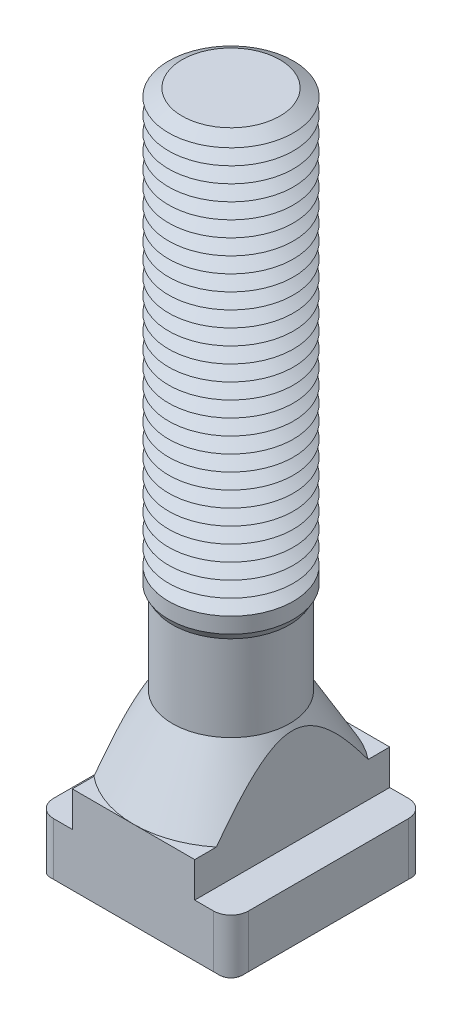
ISO-10303-21;
HEADER;
FILE_DESCRIPTION(('STEP AP214'),'2;1');
FILE_NAME('part.step','',(''),(''),'','','');
FILE_SCHEMA(('AUTOMOTIVE_DESIGN { 1 0 10303 214 1 1 1 1 }'));
ENDSEC;
DATA;
#1=APPLICATION_CONTEXT('core data for automotive mechanical design processes');
#2=APPLICATION_PROTOCOL_DEFINITION('international standard','automotive_design',2000,#1);
#3=PRODUCT_CONTEXT('',#1,'mechanical');
#4=PRODUCT('Part','Part','',(#3));
#5=PRODUCT_RELATED_PRODUCT_CATEGORY('part','',(#4));
#6=PRODUCT_DEFINITION_FORMATION('','',#4);
#7=PRODUCT_DEFINITION_CONTEXT('part definition',#1,'design');
#8=PRODUCT_DEFINITION('design','',#6,#7);
#9=PRODUCT_DEFINITION_SHAPE('','',#8);
#10=(LENGTH_UNIT() NAMED_UNIT(*) SI_UNIT(.MILLI.,.METRE.));
#11=(NAMED_UNIT(*) PLANE_ANGLE_UNIT() SI_UNIT($,.RADIAN.));
#12=(NAMED_UNIT(*) SI_UNIT($,.STERADIAN.) SOLID_ANGLE_UNIT());
#13=UNCERTAINTY_MEASURE_WITH_UNIT(LENGTH_MEASURE(1.E-05),#10,'distance_accuracy_value','');
#14=(GEOMETRIC_REPRESENTATION_CONTEXT(3) GLOBAL_UNCERTAINTY_ASSIGNED_CONTEXT((#13)) GLOBAL_UNIT_ASSIGNED_CONTEXT((#10,
#11,#12)) REPRESENTATION_CONTEXT('',''));
#15=CARTESIAN_POINT('',(0.,0.,0.));
#16=DIRECTION('',(0.,0.,1.));
#17=DIRECTION('',(1.,0.,0.));
#18=AXIS2_PLACEMENT_3D('',#15,#16,#17);
#19=CARTESIAN_POINT('',(0.,81.,0.));
#20=DIRECTION('',(0.,-1.,0.));
#21=DIRECTION('',(0.,0.,-1.));
#22=AXIS2_PLACEMENT_3D('',#19,#20,#21);
#23=CONICAL_SURFACE('',#22,6.26794919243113,1.0471975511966);
#24=CARTESIAN_POINT('',(0.,80.,0.));
#25=DIRECTION('',(0.,-1.,0.));
#26=DIRECTION('',(0.,0.,-1.));
#27=AXIS2_PLACEMENT_3D('',#24,#25,#26);
#28=CIRCLE('',#27,8.00000000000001);
#29=CARTESIAN_POINT('',(0.,80.,-8.00000000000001));
#30=VERTEX_POINT('',#29);
#31=EDGE_CURVE('E665',#30,#30,#28,.T.);
#32=ORIENTED_EDGE('',*,*,#31,.F.);
#33=EDGE_LOOP('',(#32));
#34=FACE_BOUND('',#33,.T.);
#35=CARTESIAN_POINT('',(0.,81.,0.));
#36=DIRECTION('',(0.,-1.,0.));
#37=DIRECTION('',(0.,0.,-1.));
#38=AXIS2_PLACEMENT_3D('',#35,#36,#37);
#39=CIRCLE('',#38,6.26794919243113);
#40=CARTESIAN_POINT('',(0.,81.,-6.26794919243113));
#41=VERTEX_POINT('',#40);
#42=EDGE_CURVE('E672',#41,#41,#39,.T.);
#43=ORIENTED_EDGE('',*,*,#42,.T.);
#44=EDGE_LOOP('',(#43));
#45=FACE_BOUND('',#44,.T.);
#46=ADVANCED_FACE('F39',(#34,#45),#23,.T.);
#47=CARTESIAN_POINT('',(0.,82.,0.));
#48=DIRECTION('',(0.,1.,0.));
#49=DIRECTION('',(0.,0.,1.));
#50=AXIS2_PLACEMENT_3D('',#47,#48,#49);
#51=CONICAL_SURFACE('',#50,8.00000000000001,1.0471975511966);
#52=ORIENTED_EDGE('',*,*,#42,.F.);
#53=EDGE_LOOP('',(#52));
#54=FACE_BOUND('',#53,.T.);
#55=CARTESIAN_POINT('',(0.,82.,0.));
#56=DIRECTION('',(0.,-1.,0.));
#57=DIRECTION('',(0.,0.,-1.));
#58=AXIS2_PLACEMENT_3D('',#55,#56,#57);
#59=CIRCLE('',#58,8.00000000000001);
#60=CARTESIAN_POINT('',(0.,82.,-8.00000000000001));
#61=VERTEX_POINT('',#60);
#62=EDGE_CURVE('E668',#61,#61,#59,.T.);
#63=ORIENTED_EDGE('',*,*,#62,.T.);
#64=EDGE_LOOP('',(#63));
#65=FACE_BOUND('',#64,.T.);
#66=ADVANCED_FACE('F449',(#54,#65),#51,.T.);
#67=CARTESIAN_POINT('',(3.9612160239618,89.,0.));
#68=DIRECTION('',(0.,-1.,0.));
#69=DIRECTION('',(1.,0.,0.));
#70=AXIS2_PLACEMENT_3D('',#67,#68,#69);
#71=PLANE('',#70);
#72=CARTESIAN_POINT('',(0.,89.,0.));
#73=DIRECTION('',(0.,-1.,0.));
#74=DIRECTION('',(0.,0.,-1.));
#75=AXIS2_PLACEMENT_3D('',#72,#73,#74);
#76=CIRCLE('',#75,6.26794919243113);
#77=CARTESIAN_POINT('',(0.,89.,-6.26794919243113));
#78=VERTEX_POINT('',#77);
#79=EDGE_CURVE('E712',#78,#78,#76,.T.);
#80=ORIENTED_EDGE('',*,*,#79,.F.);
#81=EDGE_LOOP('',(#80));
#82=FACE_BOUND('',#81,.T.);
#83=ADVANCED_FACE('F455',(#82),#71,.F.);
#84=CARTESIAN_POINT('',(0.,89.,0.));
#85=DIRECTION('',(0.,-1.,0.));
#86=DIRECTION('',(0.,0.,-1.));
#87=AXIS2_PLACEMENT_3D('',#84,#85,#86);
#88=CONICAL_SURFACE('',#87,6.26794919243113,1.0471975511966);
#89=CARTESIAN_POINT('',(0.,88.,0.));
#90=DIRECTION('',(0.,-1.,0.));
#91=DIRECTION('',(0.,0.,-1.));
#92=AXIS2_PLACEMENT_3D('',#89,#90,#91);
#93=CIRCLE('',#92,8.00000000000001);
#94=CARTESIAN_POINT('',(0.,88.,-8.00000000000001));
#95=VERTEX_POINT('',#94);
#96=EDGE_CURVE('E702',#95,#95,#93,.T.);
#97=ORIENTED_EDGE('',*,*,#96,.F.);
#98=EDGE_LOOP('',(#97));
#99=FACE_BOUND('',#98,.T.);
#100=ORIENTED_EDGE('',*,*,#79,.T.);
#101=EDGE_LOOP('',(#100));
#102=FACE_BOUND('',#101,.T.);
#103=ADVANCED_FACE('F483',(#99,#102),#88,.T.);
#104=CARTESIAN_POINT('',(0.,88.,0.));
#105=DIRECTION('',(0.,1.,0.));
#106=DIRECTION('',(0.,0.,1.));
#107=AXIS2_PLACEMENT_3D('',#104,#105,#106);
#108=CONICAL_SURFACE('',#107,8.00000000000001,1.0471975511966);
#109=CARTESIAN_POINT('',(0.,87.,0.));
#110=DIRECTION('',(0.,-1.,0.));
#111=DIRECTION('',(0.,0.,-1.));
#112=AXIS2_PLACEMENT_3D('',#109,#110,#111);
#113=CIRCLE('',#112,6.26794919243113);
#114=CARTESIAN_POINT('',(0.,87.,-6.26794919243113));
#115=VERTEX_POINT('',#114);
#116=EDGE_CURVE('E695',#115,#115,#113,.T.);
#117=ORIENTED_EDGE('',*,*,#116,.F.);
#118=EDGE_LOOP('',(#117));
#119=FACE_BOUND('',#118,.T.);
#120=ORIENTED_EDGE('',*,*,#96,.T.);
#121=EDGE_LOOP('',(#120));
#122=FACE_BOUND('',#121,.T.);
#123=ADVANCED_FACE('F480',(#119,#122),#108,.T.);
#124=CARTESIAN_POINT('',(0.,87.,0.));
#125=DIRECTION('',(0.,-1.,0.));
#126=DIRECTION('',(0.,0.,-1.));
#127=AXIS2_PLACEMENT_3D('',#124,#125,#126);
#128=CONICAL_SURFACE('',#127,6.26794919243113,1.0471975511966);
#129=CARTESIAN_POINT('',(0.,86.,0.));
#130=DIRECTION('',(0.,-1.,0.));
#131=DIRECTION('',(0.,0.,-1.));
#132=AXIS2_PLACEMENT_3D('',#129,#130,#131);
#133=CIRCLE('',#132,8.00000000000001);
#134=CARTESIAN_POINT('',(0.,86.,-8.00000000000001));
#135=VERTEX_POINT('',#134);
#136=EDGE_CURVE('E693',#135,#135,#133,.T.);
#137=ORIENTED_EDGE('',*,*,#136,.F.);
#138=EDGE_LOOP('',(#137));
#139=FACE_BOUND('',#138,.T.);
#140=ORIENTED_EDGE('',*,*,#116,.T.);
#141=EDGE_LOOP('',(#140));
#142=FACE_BOUND('',#141,.T.);
#143=ADVANCED_FACE('F475',(#139,#142),#128,.T.);
#144=CARTESIAN_POINT('',(0.,86.,0.));
#145=DIRECTION('',(0.,1.,0.));
#146=DIRECTION('',(0.,0.,1.));
#147=AXIS2_PLACEMENT_3D('',#144,#145,#146);
#148=CONICAL_SURFACE('',#147,8.00000000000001,1.0471975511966);
#149=CARTESIAN_POINT('',(0.,85.,0.));
#150=DIRECTION('',(0.,-1.,0.));
#151=DIRECTION('',(0.,0.,-1.));
#152=AXIS2_PLACEMENT_3D('',#149,#150,#151);
#153=CIRCLE('',#152,6.26794919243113);
#154=CARTESIAN_POINT('',(0.,85.,-6.26794919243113));
#155=VERTEX_POINT('',#154);
#156=EDGE_CURVE('E696',#155,#155,#153,.T.);
#157=ORIENTED_EDGE('',*,*,#156,.F.);
#158=EDGE_LOOP('',(#157));
#159=FACE_BOUND('',#158,.T.);
#160=ORIENTED_EDGE('',*,*,#136,.T.);
#161=EDGE_LOOP('',(#160));
#162=FACE_BOUND('',#161,.T.);
#163=ADVANCED_FACE('F472',(#159,#162),#148,.T.);
#164=CARTESIAN_POINT('',(0.,85.,0.));
#165=DIRECTION('',(0.,-1.,0.));
#166=DIRECTION('',(0.,0.,-1.));
#167=AXIS2_PLACEMENT_3D('',#164,#165,#166);
#168=CONICAL_SURFACE('',#167,6.26794919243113,1.0471975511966);
#169=CARTESIAN_POINT('',(0.,84.,0.));
#170=DIRECTION('',(0.,-1.,0.));
#171=DIRECTION('',(0.,0.,-1.));
#172=AXIS2_PLACEMENT_3D('',#169,#170,#171);
#173=CIRCLE('',#172,8.00000000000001);
#174=CARTESIAN_POINT('',(0.,84.,-8.00000000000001));
#175=VERTEX_POINT('',#174);
#176=EDGE_CURVE('E691',#175,#175,#173,.T.);
#177=ORIENTED_EDGE('',*,*,#176,.F.);
#178=EDGE_LOOP('',(#177));
#179=FACE_BOUND('',#178,.T.);
#180=ORIENTED_EDGE('',*,*,#156,.T.);
#181=EDGE_LOOP('',(#180));
#182=FACE_BOUND('',#181,.T.);
#183=ADVANCED_FACE('F466',(#179,#182),#168,.T.);
#184=CARTESIAN_POINT('',(0.,84.,0.));
#185=DIRECTION('',(0.,1.,0.));
#186=DIRECTION('',(0.,0.,1.));
#187=AXIS2_PLACEMENT_3D('',#184,#185,#186);
#188=CONICAL_SURFACE('',#187,8.00000000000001,1.0471975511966);
#189=CARTESIAN_POINT('',(0.,83.,0.));
#190=DIRECTION('',(0.,-1.,0.));
#191=DIRECTION('',(0.,0.,-1.));
#192=AXIS2_PLACEMENT_3D('',#189,#190,#191);
#193=CIRCLE('',#192,6.26794919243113);
#194=CARTESIAN_POINT('',(0.,83.,-6.26794919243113));
#195=VERTEX_POINT('',#194);
#196=EDGE_CURVE('E671',#195,#195,#193,.T.);
#197=ORIENTED_EDGE('',*,*,#196,.F.);
#198=EDGE_LOOP('',(#197));
#199=FACE_BOUND('',#198,.T.);
#200=ORIENTED_EDGE('',*,*,#176,.T.);
#201=EDGE_LOOP('',(#200));
#202=FACE_BOUND('',#201,.T.);
#203=ADVANCED_FACE('F462',(#199,#202),#188,.T.);
#204=CARTESIAN_POINT('',(0.,83.,0.));
#205=DIRECTION('',(0.,-1.,0.));
#206=DIRECTION('',(0.,0.,-1.));
#207=AXIS2_PLACEMENT_3D('',#204,#205,#206);
#208=CONICAL_SURFACE('',#207,6.26794919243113,1.0471975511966);
#209=ORIENTED_EDGE('',*,*,#62,.F.);
#210=EDGE_LOOP('',(#209));
#211=FACE_BOUND('',#210,.T.);
#212=ORIENTED_EDGE('',*,*,#196,.T.);
#213=EDGE_LOOP('',(#212));
#214=FACE_BOUND('',#213,.T.);
#215=ADVANCED_FACE('F465',(#211,#214),#208,.T.);
#216=CARTESIAN_POINT('',(0.,79.,0.));
#217=DIRECTION('',(0.,-1.,0.));
#218=DIRECTION('',(0.,0.,-1.));
#219=AXIS2_PLACEMENT_3D('',#216,#217,#218);
#220=CONICAL_SURFACE('',#219,6.26794919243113,1.0471975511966);
#221=CARTESIAN_POINT('',(0.,78.,0.));
#222=DIRECTION('',(0.,-1.,0.));
#223=DIRECTION('',(0.,0.,-1.));
#224=AXIS2_PLACEMENT_3D('',#221,#222,#223);
#225=CIRCLE('',#224,8.00000000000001);
#226=CARTESIAN_POINT('',(0.,78.,-8.00000000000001));
#227=VERTEX_POINT('',#226);
#228=EDGE_CURVE('E666',#227,#227,#225,.T.);
#229=ORIENTED_EDGE('',*,*,#228,.F.);
#230=EDGE_LOOP('',(#229));
#231=FACE_BOUND('',#230,.T.);
#232=CARTESIAN_POINT('',(0.,79.,0.));
#233=DIRECTION('',(0.,-1.,0.));
#234=DIRECTION('',(0.,0.,-1.));
#235=AXIS2_PLACEMENT_3D('',#232,#233,#234);
#236=CIRCLE('',#235,6.26794919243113);
#237=CARTESIAN_POINT('',(0.,79.,-6.26794919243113));
#238=VERTEX_POINT('',#237);
#239=EDGE_CURVE('E662',#238,#238,#236,.T.);
#240=ORIENTED_EDGE('',*,*,#239,.T.);
#241=EDGE_LOOP('',(#240));
#242=FACE_BOUND('',#241,.T.);
#243=ADVANCED_FACE('F470',(#231,#242),#220,.T.);
#244=CARTESIAN_POINT('',(0.,80.,0.));
#245=DIRECTION('',(0.,1.,0.));
#246=DIRECTION('',(0.,0.,1.));
#247=AXIS2_PLACEMENT_3D('',#244,#245,#246);
#248=CONICAL_SURFACE('',#247,8.00000000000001,1.0471975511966);
#249=ORIENTED_EDGE('',*,*,#239,.F.);
#250=EDGE_LOOP('',(#249));
#251=FACE_BOUND('',#250,.T.);
#252=ORIENTED_EDGE('',*,*,#31,.T.);
#253=EDGE_LOOP('',(#252));
#254=FACE_BOUND('',#253,.T.);
#255=ADVANCED_FACE('F870',(#251,#254),#248,.T.);
#256=CARTESIAN_POINT('',(0.,77.,0.));
#257=DIRECTION('',(0.,-1.,0.));
#258=DIRECTION('',(0.,0.,-1.));
#259=AXIS2_PLACEMENT_3D('',#256,#257,#258);
#260=CONICAL_SURFACE('',#259,6.26794919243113,1.0471975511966);
#261=CARTESIAN_POINT('',(0.,76.,0.));
#262=DIRECTION('',(0.,-1.,0.));
#263=DIRECTION('',(0.,0.,-1.));
#264=AXIS2_PLACEMENT_3D('',#261,#262,#263);
#265=CIRCLE('',#264,8.00000000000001);
#266=CARTESIAN_POINT('',(0.,76.,-8.00000000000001));
#267=VERTEX_POINT('',#266);
#268=EDGE_CURVE('E749',#267,#267,#265,.T.);
#269=ORIENTED_EDGE('',*,*,#268,.F.);
#270=EDGE_LOOP('',(#269));
#271=FACE_BOUND('',#270,.T.);
#272=CARTESIAN_POINT('',(0.,77.,0.));
#273=DIRECTION('',(0.,-1.,0.));
#274=DIRECTION('',(0.,0.,-1.));
#275=AXIS2_PLACEMENT_3D('',#272,#273,#274);
#276=CIRCLE('',#275,6.26794919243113);
#277=CARTESIAN_POINT('',(0.,77.,-6.26794919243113));
#278=VERTEX_POINT('',#277);
#279=EDGE_CURVE('E759',#278,#278,#276,.T.);
#280=ORIENTED_EDGE('',*,*,#279,.T.);
#281=EDGE_LOOP('',(#280));
#282=FACE_BOUND('',#281,.T.);
#283=ADVANCED_FACE('F866',(#271,#282),#260,.T.);
#284=CARTESIAN_POINT('',(0.,78.,0.));
#285=DIRECTION('',(0.,1.,0.));
#286=DIRECTION('',(0.,0.,1.));
#287=AXIS2_PLACEMENT_3D('',#284,#285,#286);
#288=CONICAL_SURFACE('',#287,8.00000000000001,1.0471975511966);
#289=ORIENTED_EDGE('',*,*,#279,.F.);
#290=EDGE_LOOP('',(#289));
#291=FACE_BOUND('',#290,.T.);
#292=ORIENTED_EDGE('',*,*,#228,.T.);
#293=EDGE_LOOP('',(#292));
#294=FACE_BOUND('',#293,.T.);
#295=ADVANCED_FACE('F862',(#291,#294),#288,.T.);
#296=CARTESIAN_POINT('',(0.,75.,0.));
#297=DIRECTION('',(0.,-1.,0.));
#298=DIRECTION('',(0.,0.,-1.));
#299=AXIS2_PLACEMENT_3D('',#296,#297,#298);
#300=CONICAL_SURFACE('',#299,6.26794919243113,1.0471975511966);
#301=CARTESIAN_POINT('',(0.,74.,0.));
#302=DIRECTION('',(0.,-1.,0.));
#303=DIRECTION('',(0.,0.,-1.));
#304=AXIS2_PLACEMENT_3D('',#301,#302,#303);
#305=CIRCLE('',#304,8.00000000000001);
#306=CARTESIAN_POINT('',(0.,74.,-8.00000000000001));
#307=VERTEX_POINT('',#306);
#308=EDGE_CURVE('E740',#307,#307,#305,.T.);
#309=ORIENTED_EDGE('',*,*,#308,.F.);
#310=EDGE_LOOP('',(#309));
#311=FACE_BOUND('',#310,.T.);
#312=CARTESIAN_POINT('',(0.,75.,0.));
#313=DIRECTION('',(0.,-1.,0.));
#314=DIRECTION('',(0.,0.,-1.));
#315=AXIS2_PLACEMENT_3D('',#312,#313,#314);
#316=CIRCLE('',#315,6.26794919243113);
#317=CARTESIAN_POINT('',(0.,75.,-6.26794919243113));
#318=VERTEX_POINT('',#317);
#319=EDGE_CURVE('E742',#318,#318,#316,.T.);
#320=ORIENTED_EDGE('',*,*,#319,.T.);
#321=EDGE_LOOP('',(#320));
#322=FACE_BOUND('',#321,.T.);
#323=ADVANCED_FACE('F858',(#311,#322),#300,.T.);
#324=CARTESIAN_POINT('',(0.,76.,0.));
#325=DIRECTION('',(0.,1.,0.));
#326=DIRECTION('',(0.,0.,1.));
#327=AXIS2_PLACEMENT_3D('',#324,#325,#326);
#328=CONICAL_SURFACE('',#327,8.00000000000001,1.0471975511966);
#329=ORIENTED_EDGE('',*,*,#319,.F.);
#330=EDGE_LOOP('',(#329));
#331=FACE_BOUND('',#330,.T.);
#332=ORIENTED_EDGE('',*,*,#268,.T.);
#333=EDGE_LOOP('',(#332));
#334=FACE_BOUND('',#333,.T.);
#335=ADVANCED_FACE('F842',(#331,#334),#328,.T.);
#336=CARTESIAN_POINT('',(0.,73.,0.));
#337=DIRECTION('',(0.,-1.,0.));
#338=DIRECTION('',(0.,0.,-1.));
#339=AXIS2_PLACEMENT_3D('',#336,#337,#338);
#340=CONICAL_SURFACE('',#339,6.26794919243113,1.0471975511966);
#341=CARTESIAN_POINT('',(0.,72.,0.));
#342=DIRECTION('',(0.,-1.,0.));
#343=DIRECTION('',(0.,0.,-1.));
#344=AXIS2_PLACEMENT_3D('',#341,#342,#343);
#345=CIRCLE('',#344,8.00000000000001);
#346=CARTESIAN_POINT('',(0.,72.,-8.00000000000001));
#347=VERTEX_POINT('',#346);
#348=EDGE_CURVE('E688',#347,#347,#345,.T.);
#349=ORIENTED_EDGE('',*,*,#348,.F.);
#350=EDGE_LOOP('',(#349));
#351=FACE_BOUND('',#350,.T.);
#352=CARTESIAN_POINT('',(0.,73.,0.));
#353=DIRECTION('',(0.,-1.,0.));
#354=DIRECTION('',(0.,0.,-1.));
#355=AXIS2_PLACEMENT_3D('',#352,#353,#354);
#356=CIRCLE('',#355,6.26794919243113);
#357=CARTESIAN_POINT('',(0.,73.,-6.26794919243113));
#358=VERTEX_POINT('',#357);
#359=EDGE_CURVE('E743',#358,#358,#356,.T.);
#360=ORIENTED_EDGE('',*,*,#359,.T.);
#361=EDGE_LOOP('',(#360));
#362=FACE_BOUND('',#361,.T.);
#363=ADVANCED_FACE('F838',(#351,#362),#340,.T.);
#364=CARTESIAN_POINT('',(0.,74.,0.));
#365=DIRECTION('',(0.,1.,0.));
#366=DIRECTION('',(0.,0.,1.));
#367=AXIS2_PLACEMENT_3D('',#364,#365,#366);
#368=CONICAL_SURFACE('',#367,8.00000000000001,1.0471975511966);
#369=ORIENTED_EDGE('',*,*,#359,.F.);
#370=EDGE_LOOP('',(#369));
#371=FACE_BOUND('',#370,.T.);
#372=ORIENTED_EDGE('',*,*,#308,.T.);
#373=EDGE_LOOP('',(#372));
#374=FACE_BOUND('',#373,.T.);
#375=ADVANCED_FACE('F841',(#371,#374),#368,.T.);
#376=CARTESIAN_POINT('',(0.,71.,0.));
#377=DIRECTION('',(0.,-1.,0.));
#378=DIRECTION('',(0.,0.,-1.));
#379=AXIS2_PLACEMENT_3D('',#376,#377,#378);
#380=CONICAL_SURFACE('',#379,6.26794919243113,1.0471975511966);
#381=CARTESIAN_POINT('',(0.,70.,0.));
#382=DIRECTION('',(0.,-1.,0.));
#383=DIRECTION('',(0.,0.,-1.));
#384=AXIS2_PLACEMENT_3D('',#381,#382,#383);
#385=CIRCLE('',#384,8.00000000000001);
#386=CARTESIAN_POINT('',(0.,70.,-8.00000000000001));
#387=VERTEX_POINT('',#386);
#388=EDGE_CURVE('E656',#387,#387,#385,.T.);
#389=ORIENTED_EDGE('',*,*,#388,.F.);
#390=EDGE_LOOP('',(#389));
#391=FACE_BOUND('',#390,.T.);
#392=CARTESIAN_POINT('',(0.,71.,0.));
#393=DIRECTION('',(0.,-1.,0.));
#394=DIRECTION('',(0.,0.,-1.));
#395=AXIS2_PLACEMENT_3D('',#392,#393,#394);
#396=CIRCLE('',#395,6.26794919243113);
#397=CARTESIAN_POINT('',(0.,71.,-6.26794919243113));
#398=VERTEX_POINT('',#397);
#399=EDGE_CURVE('E659',#398,#398,#396,.T.);
#400=ORIENTED_EDGE('',*,*,#399,.T.);
#401=EDGE_LOOP('',(#400));
#402=FACE_BOUND('',#401,.T.);
#403=ADVANCED_FACE('F847',(#391,#402),#380,.T.);
#404=CARTESIAN_POINT('',(0.,72.,0.));
#405=DIRECTION('',(0.,1.,0.));
#406=DIRECTION('',(0.,0.,1.));
#407=AXIS2_PLACEMENT_3D('',#404,#405,#406);
#408=CONICAL_SURFACE('',#407,8.00000000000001,1.0471975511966);
#409=ORIENTED_EDGE('',*,*,#399,.F.);
#410=EDGE_LOOP('',(#409));
#411=FACE_BOUND('',#410,.T.);
#412=ORIENTED_EDGE('',*,*,#348,.T.);
#413=EDGE_LOOP('',(#412));
#414=FACE_BOUND('',#413,.T.);
#415=ADVANCED_FACE('F836',(#411,#414),#408,.T.);
#416=CARTESIAN_POINT('',(0.,69.,0.));
#417=DIRECTION('',(0.,-1.,0.));
#418=DIRECTION('',(0.,0.,-1.));
#419=AXIS2_PLACEMENT_3D('',#416,#417,#418);
#420=CONICAL_SURFACE('',#419,6.26794919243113,1.0471975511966);
#421=CARTESIAN_POINT('',(0.,68.,0.));
#422=DIRECTION('',(0.,-1.,0.));
#423=DIRECTION('',(0.,0.,-1.));
#424=AXIS2_PLACEMENT_3D('',#421,#422,#423);
#425=CIRCLE('',#424,8.00000000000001);
#426=CARTESIAN_POINT('',(0.,68.,-8.00000000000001));
#427=VERTEX_POINT('',#426);
#428=EDGE_CURVE('E827',#427,#427,#425,.T.);
#429=ORIENTED_EDGE('',*,*,#428,.F.);
#430=EDGE_LOOP('',(#429));
#431=FACE_BOUND('',#430,.T.);
#432=CARTESIAN_POINT('',(0.,69.,0.));
#433=DIRECTION('',(0.,-1.,0.));
#434=DIRECTION('',(0.,0.,-1.));
#435=AXIS2_PLACEMENT_3D('',#432,#433,#434);
#436=CIRCLE('',#435,6.26794919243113);
#437=CARTESIAN_POINT('',(0.,69.,-6.26794919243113));
#438=VERTEX_POINT('',#437);
#439=EDGE_CURVE('E660',#438,#438,#436,.T.);
#440=ORIENTED_EDGE('',*,*,#439,.T.);
#441=EDGE_LOOP('',(#440));
#442=FACE_BOUND('',#441,.T.);
#443=ADVANCED_FACE('F918',(#431,#442),#420,.T.);
#444=CARTESIAN_POINT('',(0.,70.,0.));
#445=DIRECTION('',(0.,1.,0.));
#446=DIRECTION('',(0.,0.,1.));
#447=AXIS2_PLACEMENT_3D('',#444,#445,#446);
#448=CONICAL_SURFACE('',#447,8.00000000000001,1.0471975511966);
#449=ORIENTED_EDGE('',*,*,#439,.F.);
#450=EDGE_LOOP('',(#449));
#451=FACE_BOUND('',#450,.T.);
#452=ORIENTED_EDGE('',*,*,#388,.T.);
#453=EDGE_LOOP('',(#452));
#454=FACE_BOUND('',#453,.T.);
#455=ADVANCED_FACE('F926',(#451,#454),#448,.T.);
#456=CARTESIAN_POINT('',(0.,67.,0.));
#457=DIRECTION('',(0.,-1.,0.));
#458=DIRECTION('',(0.,0.,-1.));
#459=AXIS2_PLACEMENT_3D('',#456,#457,#458);
#460=CONICAL_SURFACE('',#459,6.26794919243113,1.0471975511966);
#461=CARTESIAN_POINT('',(0.,66.,0.));
#462=DIRECTION('',(0.,-1.,0.));
#463=DIRECTION('',(0.,0.,-1.));
#464=AXIS2_PLACEMENT_3D('',#461,#462,#463);
#465=CIRCLE('',#464,8.00000000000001);
#466=CARTESIAN_POINT('',(0.,66.,-8.00000000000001));
#467=VERTEX_POINT('',#466);
#468=EDGE_CURVE('E734',#467,#467,#465,.T.);
#469=ORIENTED_EDGE('',*,*,#468,.F.);
#470=EDGE_LOOP('',(#469));
#471=FACE_BOUND('',#470,.T.);
#472=CARTESIAN_POINT('',(0.,67.,0.));
#473=DIRECTION('',(0.,-1.,0.));
#474=DIRECTION('',(0.,0.,-1.));
#475=AXIS2_PLACEMENT_3D('',#472,#473,#474);
#476=CIRCLE('',#475,6.26794919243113);
#477=CARTESIAN_POINT('',(0.,67.,-6.26794919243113));
#478=VERTEX_POINT('',#477);
#479=EDGE_CURVE('E737',#478,#478,#476,.T.);
#480=ORIENTED_EDGE('',*,*,#479,.T.);
#481=EDGE_LOOP('',(#480));
#482=FACE_BOUND('',#481,.T.);
#483=ADVANCED_FACE('F935',(#471,#482),#460,.T.);
#484=CARTESIAN_POINT('',(0.,68.,0.));
#485=DIRECTION('',(0.,1.,0.));
#486=DIRECTION('',(0.,0.,1.));
#487=AXIS2_PLACEMENT_3D('',#484,#485,#486);
#488=CONICAL_SURFACE('',#487,8.00000000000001,1.0471975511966);
#489=ORIENTED_EDGE('',*,*,#479,.F.);
#490=EDGE_LOOP('',(#489));
#491=FACE_BOUND('',#490,.T.);
#492=ORIENTED_EDGE('',*,*,#428,.T.);
#493=EDGE_LOOP('',(#492));
#494=FACE_BOUND('',#493,.T.);
#495=ADVANCED_FACE('F944',(#491,#494),#488,.T.);
#496=CARTESIAN_POINT('',(0.,65.,0.));
#497=DIRECTION('',(0.,-1.,0.));
#498=DIRECTION('',(0.,0.,-1.));
#499=AXIS2_PLACEMENT_3D('',#496,#497,#498);
#500=CONICAL_SURFACE('',#499,6.26794919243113,1.0471975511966);
#501=CARTESIAN_POINT('',(0.,64.,0.));
#502=DIRECTION('',(0.,-1.,0.));
#503=DIRECTION('',(0.,0.,-1.));
#504=AXIS2_PLACEMENT_3D('',#501,#502,#503);
#505=CIRCLE('',#504,8.00000000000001);
#506=CARTESIAN_POINT('',(0.,64.,-8.00000000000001));
#507=VERTEX_POINT('',#506);
#508=EDGE_CURVE('E818',#507,#507,#505,.T.);
#509=ORIENTED_EDGE('',*,*,#508,.F.);
#510=EDGE_LOOP('',(#509));
#511=FACE_BOUND('',#510,.T.);
#512=CARTESIAN_POINT('',(0.,65.,0.));
#513=DIRECTION('',(0.,-1.,0.));
#514=DIRECTION('',(0.,0.,-1.));
#515=AXIS2_PLACEMENT_3D('',#512,#513,#514);
#516=CIRCLE('',#515,6.26794919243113);
#517=CARTESIAN_POINT('',(0.,65.,-6.26794919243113));
#518=VERTEX_POINT('',#517);
#519=EDGE_CURVE('E738',#518,#518,#516,.T.);
#520=ORIENTED_EDGE('',*,*,#519,.T.);
#521=EDGE_LOOP('',(#520));
#522=FACE_BOUND('',#521,.T.);
#523=ADVANCED_FACE('F953',(#511,#522),#500,.T.);
#524=CARTESIAN_POINT('',(0.,66.,0.));
#525=DIRECTION('',(0.,1.,0.));
#526=DIRECTION('',(0.,0.,1.));
#527=AXIS2_PLACEMENT_3D('',#524,#525,#526);
#528=CONICAL_SURFACE('',#527,8.00000000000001,1.0471975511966);
#529=ORIENTED_EDGE('',*,*,#519,.F.);
#530=EDGE_LOOP('',(#529));
#531=FACE_BOUND('',#530,.T.);
#532=ORIENTED_EDGE('',*,*,#468,.T.);
#533=EDGE_LOOP('',(#532));
#534=FACE_BOUND('',#533,.T.);
#535=ADVANCED_FACE('F962',(#531,#534),#528,.T.);
#536=CARTESIAN_POINT('',(0.,63.,0.));
#537=DIRECTION('',(0.,-1.,0.));
#538=DIRECTION('',(0.,0.,-1.));
#539=AXIS2_PLACEMENT_3D('',#536,#537,#538);
#540=CONICAL_SURFACE('',#539,6.26794919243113,1.0471975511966);
#541=CARTESIAN_POINT('',(0.,62.,0.));
#542=DIRECTION('',(0.,-1.,0.));
#543=DIRECTION('',(0.,0.,-1.));
#544=AXIS2_PLACEMENT_3D('',#541,#542,#543);
#545=CIRCLE('',#544,8.00000000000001);
#546=CARTESIAN_POINT('',(0.,62.,-8.00000000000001));
#547=VERTEX_POINT('',#546);
#548=EDGE_CURVE('E810',#547,#547,#545,.T.);
#549=ORIENTED_EDGE('',*,*,#548,.F.);
#550=EDGE_LOOP('',(#549));
#551=FACE_BOUND('',#550,.T.);
#552=CARTESIAN_POINT('',(0.,63.,0.));
#553=DIRECTION('',(0.,-1.,0.));
#554=DIRECTION('',(0.,0.,-1.));
#555=AXIS2_PLACEMENT_3D('',#552,#553,#554);
#556=CIRCLE('',#555,6.26794919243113);
#557=CARTESIAN_POINT('',(0.,63.,-6.26794919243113));
#558=VERTEX_POINT('',#557);
#559=EDGE_CURVE('E814',#558,#558,#556,.T.);
#560=ORIENTED_EDGE('',*,*,#559,.T.);
#561=EDGE_LOOP('',(#560));
#562=FACE_BOUND('',#561,.T.);
#563=ADVANCED_FACE('F971',(#551,#562),#540,.T.);
#564=CARTESIAN_POINT('',(0.,64.,0.));
#565=DIRECTION('',(0.,1.,0.));
#566=DIRECTION('',(0.,0.,1.));
#567=AXIS2_PLACEMENT_3D('',#564,#565,#566);
#568=CONICAL_SURFACE('',#567,8.00000000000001,1.0471975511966);
#569=ORIENTED_EDGE('',*,*,#559,.F.);
#570=EDGE_LOOP('',(#569));
#571=FACE_BOUND('',#570,.T.);
#572=ORIENTED_EDGE('',*,*,#508,.T.);
#573=EDGE_LOOP('',(#572));
#574=FACE_BOUND('',#573,.T.);
#575=ADVANCED_FACE('F980',(#571,#574),#568,.T.);
#576=CARTESIAN_POINT('',(0.,61.,0.));
#577=DIRECTION('',(0.,-1.,0.));
#578=DIRECTION('',(0.,0.,-1.));
#579=AXIS2_PLACEMENT_3D('',#576,#577,#578);
#580=CONICAL_SURFACE('',#579,6.26794919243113,1.0471975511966);
#581=CARTESIAN_POINT('',(0.,60.,0.));
#582=DIRECTION('',(0.,-1.,0.));
#583=DIRECTION('',(0.,0.,-1.));
#584=AXIS2_PLACEMENT_3D('',#581,#582,#583);
#585=CIRCLE('',#584,8.00000000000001);
#586=CARTESIAN_POINT('',(0.,60.,-8.00000000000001));
#587=VERTEX_POINT('',#586);
#588=EDGE_CURVE('E802',#587,#587,#585,.T.);
#589=ORIENTED_EDGE('',*,*,#588,.F.);
#590=EDGE_LOOP('',(#589));
#591=FACE_BOUND('',#590,.T.);
#592=CARTESIAN_POINT('',(0.,61.,0.));
#593=DIRECTION('',(0.,-1.,0.));
#594=DIRECTION('',(0.,0.,-1.));
#595=AXIS2_PLACEMENT_3D('',#592,#593,#594);
#596=CIRCLE('',#595,6.26794919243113);
#597=CARTESIAN_POINT('',(0.,61.,-6.26794919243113));
#598=VERTEX_POINT('',#597);
#599=EDGE_CURVE('E806',#598,#598,#596,.T.);
#600=ORIENTED_EDGE('',*,*,#599,.T.);
#601=EDGE_LOOP('',(#600));
#602=FACE_BOUND('',#601,.T.);
#603=ADVANCED_FACE('F989',(#591,#602),#580,.T.);
#604=CARTESIAN_POINT('',(0.,62.,0.));
#605=DIRECTION('',(0.,1.,0.));
#606=DIRECTION('',(0.,0.,1.));
#607=AXIS2_PLACEMENT_3D('',#604,#605,#606);
#608=CONICAL_SURFACE('',#607,8.00000000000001,1.0471975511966);
#609=ORIENTED_EDGE('',*,*,#599,.F.);
#610=EDGE_LOOP('',(#609));
#611=FACE_BOUND('',#610,.T.);
#612=ORIENTED_EDGE('',*,*,#548,.T.);
#613=EDGE_LOOP('',(#612));
#614=FACE_BOUND('',#613,.T.);
#615=ADVANCED_FACE('F998',(#611,#614),#608,.T.);
#616=CARTESIAN_POINT('',(0.,59.,0.));
#617=DIRECTION('',(0.,-1.,0.));
#618=DIRECTION('',(0.,0.,-1.));
#619=AXIS2_PLACEMENT_3D('',#616,#617,#618);
#620=CONICAL_SURFACE('',#619,6.26794919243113,1.0471975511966);
#621=CARTESIAN_POINT('',(0.,58.,0.));
#622=DIRECTION('',(0.,-1.,0.));
#623=DIRECTION('',(0.,0.,-1.));
#624=AXIS2_PLACEMENT_3D('',#621,#622,#623);
#625=CIRCLE('',#624,8.00000000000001);
#626=CARTESIAN_POINT('',(0.,58.,-8.00000000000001));
#627=VERTEX_POINT('',#626);
#628=EDGE_CURVE('E795',#627,#627,#625,.T.);
#629=ORIENTED_EDGE('',*,*,#628,.F.);
#630=EDGE_LOOP('',(#629));
#631=FACE_BOUND('',#630,.T.);
#632=CARTESIAN_POINT('',(0.,59.,0.));
#633=DIRECTION('',(0.,-1.,0.));
#634=DIRECTION('',(0.,0.,-1.));
#635=AXIS2_PLACEMENT_3D('',#632,#633,#634);
#636=CIRCLE('',#635,6.26794919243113);
#637=CARTESIAN_POINT('',(0.,59.,-6.26794919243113));
#638=VERTEX_POINT('',#637);
#639=EDGE_CURVE('E798',#638,#638,#636,.T.);
#640=ORIENTED_EDGE('',*,*,#639,.T.);
#641=EDGE_LOOP('',(#640));
#642=FACE_BOUND('',#641,.T.);
#643=ADVANCED_FACE('F1007',(#631,#642),#620,.T.);
#644=CARTESIAN_POINT('',(0.,60.,0.));
#645=DIRECTION('',(0.,1.,0.));
#646=DIRECTION('',(0.,0.,1.));
#647=AXIS2_PLACEMENT_3D('',#644,#645,#646);
#648=CONICAL_SURFACE('',#647,8.00000000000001,1.0471975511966);
#649=ORIENTED_EDGE('',*,*,#639,.F.);
#650=EDGE_LOOP('',(#649));
#651=FACE_BOUND('',#650,.T.);
#652=ORIENTED_EDGE('',*,*,#588,.T.);
#653=EDGE_LOOP('',(#652));
#654=FACE_BOUND('',#653,.T.);
#655=ADVANCED_FACE('F1016',(#651,#654),#648,.T.);
#656=CARTESIAN_POINT('',(0.,57.,0.));
#657=DIRECTION('',(0.,-1.,0.));
#658=DIRECTION('',(0.,0.,-1.));
#659=AXIS2_PLACEMENT_3D('',#656,#657,#658);
#660=CONICAL_SURFACE('',#659,6.26794919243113,1.0471975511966);
#661=CARTESIAN_POINT('',(0.,56.,0.));
#662=DIRECTION('',(0.,-1.,0.));
#663=DIRECTION('',(0.,0.,-1.));
#664=AXIS2_PLACEMENT_3D('',#661,#662,#663);
#665=CIRCLE('',#664,8.00000000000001);
#666=CARTESIAN_POINT('',(0.,56.,-8.00000000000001));
#667=VERTEX_POINT('',#666);
#668=EDGE_CURVE('E787',#667,#667,#665,.T.);
#669=ORIENTED_EDGE('',*,*,#668,.F.);
#670=EDGE_LOOP('',(#669));
#671=FACE_BOUND('',#670,.T.);
#672=CARTESIAN_POINT('',(0.,57.,0.));
#673=DIRECTION('',(0.,-1.,0.));
#674=DIRECTION('',(0.,0.,-1.));
#675=AXIS2_PLACEMENT_3D('',#672,#673,#674);
#676=CIRCLE('',#675,6.26794919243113);
#677=CARTESIAN_POINT('',(0.,57.,-6.26794919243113));
#678=VERTEX_POINT('',#677);
#679=EDGE_CURVE('E791',#678,#678,#676,.T.);
#680=ORIENTED_EDGE('',*,*,#679,.T.);
#681=EDGE_LOOP('',(#680));
#682=FACE_BOUND('',#681,.T.);
#683=ADVANCED_FACE('F1025',(#671,#682),#660,.T.);
#684=CARTESIAN_POINT('',(0.,58.,0.));
#685=DIRECTION('',(0.,1.,0.));
#686=DIRECTION('',(0.,0.,1.));
#687=AXIS2_PLACEMENT_3D('',#684,#685,#686);
#688=CONICAL_SURFACE('',#687,8.00000000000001,1.0471975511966);
#689=ORIENTED_EDGE('',*,*,#679,.F.);
#690=EDGE_LOOP('',(#689));
#691=FACE_BOUND('',#690,.T.);
#692=ORIENTED_EDGE('',*,*,#628,.T.);
#693=EDGE_LOOP('',(#692));
#694=FACE_BOUND('',#693,.T.);
#695=ADVANCED_FACE('F1034',(#691,#694),#688,.T.);
#696=CARTESIAN_POINT('',(0.,55.,0.));
#697=DIRECTION('',(0.,-1.,0.));
#698=DIRECTION('',(0.,0.,-1.));
#699=AXIS2_PLACEMENT_3D('',#696,#697,#698);
#700=CONICAL_SURFACE('',#699,6.26794919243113,1.0471975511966);
#701=CARTESIAN_POINT('',(0.,54.,0.));
#702=DIRECTION('',(0.,-1.,0.));
#703=DIRECTION('',(0.,0.,-1.));
#704=AXIS2_PLACEMENT_3D('',#701,#702,#703);
#705=CIRCLE('',#704,8.00000000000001);
#706=CARTESIAN_POINT('',(0.,54.,-8.00000000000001));
#707=VERTEX_POINT('',#706);
#708=EDGE_CURVE('E728',#707,#707,#705,.T.);
#709=ORIENTED_EDGE('',*,*,#708,.F.);
#710=EDGE_LOOP('',(#709));
#711=FACE_BOUND('',#710,.T.);
#712=CARTESIAN_POINT('',(0.,55.,0.));
#713=DIRECTION('',(0.,-1.,0.));
#714=DIRECTION('',(0.,0.,-1.));
#715=AXIS2_PLACEMENT_3D('',#712,#713,#714);
#716=CIRCLE('',#715,6.26794919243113);
#717=CARTESIAN_POINT('',(0.,55.,-6.26794919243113));
#718=VERTEX_POINT('',#717);
#719=EDGE_CURVE('E731',#718,#718,#716,.T.);
#720=ORIENTED_EDGE('',*,*,#719,.T.);
#721=EDGE_LOOP('',(#720));
#722=FACE_BOUND('',#721,.T.);
#723=ADVANCED_FACE('F1043',(#711,#722),#700,.T.);
#724=CARTESIAN_POINT('',(0.,56.,0.));
#725=DIRECTION('',(0.,1.,0.));
#726=DIRECTION('',(0.,0.,1.));
#727=AXIS2_PLACEMENT_3D('',#724,#725,#726);
#728=CONICAL_SURFACE('',#727,8.00000000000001,1.0471975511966);
#729=ORIENTED_EDGE('',*,*,#719,.F.);
#730=EDGE_LOOP('',(#729));
#731=FACE_BOUND('',#730,.T.);
#732=ORIENTED_EDGE('',*,*,#668,.T.);
#733=EDGE_LOOP('',(#732));
#734=FACE_BOUND('',#733,.T.);
#735=ADVANCED_FACE('F1052',(#731,#734),#728,.T.);
#736=CARTESIAN_POINT('',(0.,53.,0.));
#737=DIRECTION('',(0.,-1.,0.));
#738=DIRECTION('',(0.,0.,-1.));
#739=AXIS2_PLACEMENT_3D('',#736,#737,#738);
#740=CONICAL_SURFACE('',#739,6.26794919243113,1.0471975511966);
#741=CARTESIAN_POINT('',(0.,52.,0.));
#742=DIRECTION('',(0.,-1.,0.));
#743=DIRECTION('',(0.,0.,-1.));
#744=AXIS2_PLACEMENT_3D('',#741,#742,#743);
#745=CIRCLE('',#744,8.00000000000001);
#746=CARTESIAN_POINT('',(0.,52.,-8.00000000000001));
#747=VERTEX_POINT('',#746);
#748=EDGE_CURVE('E775',#747,#747,#745,.T.);
#749=ORIENTED_EDGE('',*,*,#748,.F.);
#750=EDGE_LOOP('',(#749));
#751=FACE_BOUND('',#750,.T.);
#752=CARTESIAN_POINT('',(0.,53.,0.));
#753=DIRECTION('',(0.,-1.,0.));
#754=DIRECTION('',(0.,0.,-1.));
#755=AXIS2_PLACEMENT_3D('',#752,#753,#754);
#756=CIRCLE('',#755,6.26794919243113);
#757=CARTESIAN_POINT('',(0.,53.,-6.26794919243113));
#758=VERTEX_POINT('',#757);
#759=EDGE_CURVE('E732',#758,#758,#756,.T.);
#760=ORIENTED_EDGE('',*,*,#759,.T.);
#761=EDGE_LOOP('',(#760));
#762=FACE_BOUND('',#761,.T.);
#763=ADVANCED_FACE('F1061',(#751,#762),#740,.T.);
#764=CARTESIAN_POINT('',(0.,54.,0.));
#765=DIRECTION('',(0.,1.,0.));
#766=DIRECTION('',(0.,0.,1.));
#767=AXIS2_PLACEMENT_3D('',#764,#765,#766);
#768=CONICAL_SURFACE('',#767,8.00000000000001,1.0471975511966);
#769=ORIENTED_EDGE('',*,*,#759,.F.);
#770=EDGE_LOOP('',(#769));
#771=FACE_BOUND('',#770,.T.);
#772=ORIENTED_EDGE('',*,*,#708,.T.);
#773=EDGE_LOOP('',(#772));
#774=FACE_BOUND('',#773,.T.);
#775=ADVANCED_FACE('F1070',(#771,#774),#768,.T.);
#776=CARTESIAN_POINT('',(0.,51.,0.));
#777=DIRECTION('',(0.,-1.,0.));
#778=DIRECTION('',(0.,0.,-1.));
#779=AXIS2_PLACEMENT_3D('',#776,#777,#778);
#780=CONICAL_SURFACE('',#779,6.26794919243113,1.0471975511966);
#781=CARTESIAN_POINT('',(0.,50.,0.));
#782=DIRECTION('',(0.,-1.,0.));
#783=DIRECTION('',(0.,0.,-1.));
#784=AXIS2_PLACEMENT_3D('',#781,#782,#783);
#785=CIRCLE('',#784,8.00000000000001);
#786=CARTESIAN_POINT('',(0.,50.,-8.00000000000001));
#787=VERTEX_POINT('',#786);
#788=EDGE_CURVE('E650',#787,#787,#785,.T.);
#789=ORIENTED_EDGE('',*,*,#788,.F.);
#790=EDGE_LOOP('',(#789));
#791=FACE_BOUND('',#790,.T.);
#792=CARTESIAN_POINT('',(0.,51.,0.));
#793=DIRECTION('',(0.,-1.,0.));
#794=DIRECTION('',(0.,0.,-1.));
#795=AXIS2_PLACEMENT_3D('',#792,#793,#794);
#796=CIRCLE('',#795,6.26794919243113);
#797=CARTESIAN_POINT('',(0.,51.,-6.26794919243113));
#798=VERTEX_POINT('',#797);
#799=EDGE_CURVE('E653',#798,#798,#796,.T.);
#800=ORIENTED_EDGE('',*,*,#799,.T.);
#801=EDGE_LOOP('',(#800));
#802=FACE_BOUND('',#801,.T.);
#803=ADVANCED_FACE('F1079',(#791,#802),#780,.T.);
#804=CARTESIAN_POINT('',(0.,52.,0.));
#805=DIRECTION('',(0.,1.,0.));
#806=DIRECTION('',(0.,0.,1.));
#807=AXIS2_PLACEMENT_3D('',#804,#805,#806);
#808=CONICAL_SURFACE('',#807,8.00000000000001,1.0471975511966);
#809=ORIENTED_EDGE('',*,*,#799,.F.);
#810=EDGE_LOOP('',(#809));
#811=FACE_BOUND('',#810,.T.);
#812=ORIENTED_EDGE('',*,*,#748,.T.);
#813=EDGE_LOOP('',(#812));
#814=FACE_BOUND('',#813,.T.);
#815=ADVANCED_FACE('F1088',(#811,#814),#808,.T.);
#816=CARTESIAN_POINT('',(0.,49.,0.));
#817=DIRECTION('',(0.,-1.,0.));
#818=DIRECTION('',(0.,0.,-1.));
#819=AXIS2_PLACEMENT_3D('',#816,#817,#818);
#820=CONICAL_SURFACE('',#819,6.26794919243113,1.0471975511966);
#821=CARTESIAN_POINT('',(0.,48.,0.));
#822=DIRECTION('',(0.,-1.,0.));
#823=DIRECTION('',(0.,0.,-1.));
#824=AXIS2_PLACEMENT_3D('',#821,#822,#823);
#825=CIRCLE('',#824,8.00000000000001);
#826=CARTESIAN_POINT('',(0.,48.,-8.00000000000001));
#827=VERTEX_POINT('',#826);
#828=EDGE_CURVE('E682',#827,#827,#825,.T.);
#829=ORIENTED_EDGE('',*,*,#828,.F.);
#830=EDGE_LOOP('',(#829));
#831=FACE_BOUND('',#830,.T.);
#832=CARTESIAN_POINT('',(0.,49.,0.));
#833=DIRECTION('',(0.,-1.,0.));
#834=DIRECTION('',(0.,0.,-1.));
#835=AXIS2_PLACEMENT_3D('',#832,#833,#834);
#836=CIRCLE('',#835,6.26794919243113);
#837=CARTESIAN_POINT('',(0.,49.,-6.26794919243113));
#838=VERTEX_POINT('',#837);
#839=EDGE_CURVE('E654',#838,#838,#836,.T.);
#840=ORIENTED_EDGE('',*,*,#839,.T.);
#841=EDGE_LOOP('',(#840));
#842=FACE_BOUND('',#841,.T.);
#843=ADVANCED_FACE('F1097',(#831,#842),#820,.T.);
#844=CARTESIAN_POINT('',(0.,50.,0.));
#845=DIRECTION('',(0.,1.,0.));
#846=DIRECTION('',(0.,0.,1.));
#847=AXIS2_PLACEMENT_3D('',#844,#845,#846);
#848=CONICAL_SURFACE('',#847,8.00000000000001,1.0471975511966);
#849=ORIENTED_EDGE('',*,*,#839,.F.);
#850=EDGE_LOOP('',(#849));
#851=FACE_BOUND('',#850,.T.);
#852=ORIENTED_EDGE('',*,*,#788,.T.);
#853=EDGE_LOOP('',(#852));
#854=FACE_BOUND('',#853,.T.);
#855=ADVANCED_FACE('F1106',(#851,#854),#848,.T.);
#856=CARTESIAN_POINT('',(0.,47.,0.));
#857=DIRECTION('',(0.,-1.,0.));
#858=DIRECTION('',(0.,0.,-1.));
#859=AXIS2_PLACEMENT_3D('',#856,#857,#858);
#860=CONICAL_SURFACE('',#859,6.26794919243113,1.0471975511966);
#861=CARTESIAN_POINT('',(0.,46.,0.));
#862=DIRECTION('',(0.,-1.,0.));
#863=DIRECTION('',(0.,0.,-1.));
#864=AXIS2_PLACEMENT_3D('',#861,#862,#863);
#865=CIRCLE('',#864,8.00000000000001);
#866=CARTESIAN_POINT('',(0.,46.,-8.00000000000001));
#867=VERTEX_POINT('',#866);
#868=EDGE_CURVE('E645',#867,#867,#865,.T.);
#869=ORIENTED_EDGE('',*,*,#868,.F.);
#870=EDGE_LOOP('',(#869));
#871=FACE_BOUND('',#870,.T.);
#872=CARTESIAN_POINT('',(0.,47.,0.));
#873=DIRECTION('',(0.,-1.,0.));
#874=DIRECTION('',(0.,0.,-1.));
#875=AXIS2_PLACEMENT_3D('',#872,#873,#874);
#876=CIRCLE('',#875,6.26794919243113);
#877=CARTESIAN_POINT('',(0.,47.,-6.26794919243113));
#878=VERTEX_POINT('',#877);
#879=EDGE_CURVE('E648',#878,#878,#876,.T.);
#880=ORIENTED_EDGE('',*,*,#879,.T.);
#881=EDGE_LOOP('',(#880));
#882=FACE_BOUND('',#881,.T.);
#883=ADVANCED_FACE('F1115',(#871,#882),#860,.T.);
#884=CARTESIAN_POINT('',(0.,48.,0.));
#885=DIRECTION('',(0.,1.,0.));
#886=DIRECTION('',(0.,0.,1.));
#887=AXIS2_PLACEMENT_3D('',#884,#885,#886);
#888=CONICAL_SURFACE('',#887,8.00000000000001,1.0471975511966);
#889=ORIENTED_EDGE('',*,*,#879,.F.);
#890=EDGE_LOOP('',(#889));
#891=FACE_BOUND('',#890,.T.);
#892=ORIENTED_EDGE('',*,*,#828,.T.);
#893=EDGE_LOOP('',(#892));
#894=FACE_BOUND('',#893,.T.);
#895=ADVANCED_FACE('F1124',(#891,#894),#888,.T.);
#896=CARTESIAN_POINT('',(0.,45.,0.));
#897=DIRECTION('',(0.,-1.,0.));
#898=DIRECTION('',(0.,0.,-1.));
#899=AXIS2_PLACEMENT_3D('',#896,#897,#898);
#900=CONICAL_SURFACE('',#899,6.26794919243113,1.0471975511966);
#901=CARTESIAN_POINT('',(0.,44.,0.));
#902=DIRECTION('',(0.,-1.,0.));
#903=DIRECTION('',(0.,0.,-1.));
#904=AXIS2_PLACEMENT_3D('',#901,#902,#903);
#905=CIRCLE('',#904,8.00000000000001);
#906=CARTESIAN_POINT('',(0.,44.,-8.00000000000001));
#907=VERTEX_POINT('',#906);
#908=EDGE_CURVE('E639',#907,#907,#905,.T.);
#909=ORIENTED_EDGE('',*,*,#908,.F.);
#910=EDGE_LOOP('',(#909));
#911=FACE_BOUND('',#910,.T.);
#912=CARTESIAN_POINT('',(0.,45.,0.));
#913=DIRECTION('',(0.,-1.,0.));
#914=DIRECTION('',(0.,0.,-1.));
#915=AXIS2_PLACEMENT_3D('',#912,#913,#914);
#916=CIRCLE('',#915,6.26794919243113);
#917=CARTESIAN_POINT('',(0.,45.,-6.26794919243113));
#918=VERTEX_POINT('',#917);
#919=EDGE_CURVE('E642',#918,#918,#916,.T.);
#920=ORIENTED_EDGE('',*,*,#919,.T.);
#921=EDGE_LOOP('',(#920));
#922=FACE_BOUND('',#921,.T.);
#923=ADVANCED_FACE('F1133',(#911,#922),#900,.T.);
#924=CARTESIAN_POINT('',(0.,46.,0.));
#925=DIRECTION('',(0.,1.,0.));
#926=DIRECTION('',(0.,0.,1.));
#927=AXIS2_PLACEMENT_3D('',#924,#925,#926);
#928=CONICAL_SURFACE('',#927,8.00000000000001,1.0471975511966);
#929=ORIENTED_EDGE('',*,*,#919,.F.);
#930=EDGE_LOOP('',(#929));
#931=FACE_BOUND('',#930,.T.);
#932=ORIENTED_EDGE('',*,*,#868,.T.);
#933=EDGE_LOOP('',(#932));
#934=FACE_BOUND('',#933,.T.);
#935=ADVANCED_FACE('F1142',(#931,#934),#928,.T.);
#936=CARTESIAN_POINT('',(0.,43.,0.));
#937=DIRECTION('',(0.,-1.,0.));
#938=DIRECTION('',(0.,0.,-1.));
#939=AXIS2_PLACEMENT_3D('',#936,#937,#938);
#940=CONICAL_SURFACE('',#939,6.26794919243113,1.0471975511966);
#941=CARTESIAN_POINT('',(0.,42.,0.));
#942=DIRECTION('',(0.,-1.,0.));
#943=DIRECTION('',(0.,0.,-1.));
#944=AXIS2_PLACEMENT_3D('',#941,#942,#943);
#945=CIRCLE('',#944,8.00000000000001);
#946=CARTESIAN_POINT('',(0.,42.,-8.00000000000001));
#947=VERTEX_POINT('',#946);
#948=EDGE_CURVE('E636',#947,#947,#945,.T.);
#949=ORIENTED_EDGE('',*,*,#948,.F.);
#950=EDGE_LOOP('',(#949));
#951=FACE_BOUND('',#950,.T.);
#952=CARTESIAN_POINT('',(0.,43.,0.));
#953=DIRECTION('',(0.,-1.,0.));
#954=DIRECTION('',(0.,0.,-1.));
#955=AXIS2_PLACEMENT_3D('',#952,#953,#954);
#956=CIRCLE('',#955,6.26794919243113);
#957=CARTESIAN_POINT('',(0.,43.,-6.26794919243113));
#958=VERTEX_POINT('',#957);
#959=EDGE_CURVE('E643',#958,#958,#956,.T.);
#960=ORIENTED_EDGE('',*,*,#959,.T.);
#961=EDGE_LOOP('',(#960));
#962=FACE_BOUND('',#961,.T.);
#963=ADVANCED_FACE('F1151',(#951,#962),#940,.T.);
#964=CARTESIAN_POINT('',(0.,44.,0.));
#965=DIRECTION('',(0.,1.,0.));
#966=DIRECTION('',(0.,0.,1.));
#967=AXIS2_PLACEMENT_3D('',#964,#965,#966);
#968=CONICAL_SURFACE('',#967,8.00000000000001,1.0471975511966);
#969=ORIENTED_EDGE('',*,*,#959,.F.);
#970=EDGE_LOOP('',(#969));
#971=FACE_BOUND('',#970,.T.);
#972=ORIENTED_EDGE('',*,*,#908,.T.);
#973=EDGE_LOOP('',(#972));
#974=FACE_BOUND('',#973,.T.);
#975=ADVANCED_FACE('F1160',(#971,#974),#968,.T.);
#976=CARTESIAN_POINT('',(0.,41.,0.));
#977=DIRECTION('',(0.,-1.,0.));
#978=DIRECTION('',(0.,0.,-1.));
#979=AXIS2_PLACEMENT_3D('',#976,#977,#978);
#980=CONICAL_SURFACE('',#979,6.26794919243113,1.0471975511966);
#981=CARTESIAN_POINT('',(0.,40.,0.));
#982=DIRECTION('',(0.,-1.,0.));
#983=DIRECTION('',(0.,0.,-1.));
#984=AXIS2_PLACEMENT_3D('',#981,#982,#983);
#985=CIRCLE('',#984,8.00000000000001);
#986=CARTESIAN_POINT('',(0.,40.,-8.00000000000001));
#987=VERTEX_POINT('',#986);
#988=EDGE_CURVE('E637',#987,#987,#985,.T.);
#989=ORIENTED_EDGE('',*,*,#988,.F.);
#990=EDGE_LOOP('',(#989));
#991=FACE_BOUND('',#990,.T.);
#992=CARTESIAN_POINT('',(0.,41.,0.));
#993=DIRECTION('',(0.,-1.,0.));
#994=DIRECTION('',(0.,0.,-1.));
#995=AXIS2_PLACEMENT_3D('',#992,#993,#994);
#996=CIRCLE('',#995,6.26794919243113);
#997=CARTESIAN_POINT('',(0.,41.,-6.26794919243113));
#998=VERTEX_POINT('',#997);
#999=EDGE_CURVE('E633',#998,#998,#996,.T.);
#1000=ORIENTED_EDGE('',*,*,#999,.T.);
#1001=EDGE_LOOP('',(#1000));
#1002=FACE_BOUND('',#1001,.T.);
#1003=ADVANCED_FACE('F1169',(#991,#1002),#980,.T.);
#1004=CARTESIAN_POINT('',(0.,42.,0.));
#1005=DIRECTION('',(0.,1.,0.));
#1006=DIRECTION('',(0.,0.,1.));
#1007=AXIS2_PLACEMENT_3D('',#1004,#1005,#1006);
#1008=CONICAL_SURFACE('',#1007,8.00000000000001,1.0471975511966);
#1009=ORIENTED_EDGE('',*,*,#999,.F.);
#1010=EDGE_LOOP('',(#1009));
#1011=FACE_BOUND('',#1010,.T.);
#1012=ORIENTED_EDGE('',*,*,#948,.T.);
#1013=EDGE_LOOP('',(#1012));
#1014=FACE_BOUND('',#1013,.T.);
#1015=ADVANCED_FACE('F1178',(#1011,#1014),#1008,.T.);
#1016=CARTESIAN_POINT('',(0.,39.,0.));
#1017=DIRECTION('',(0.,-1.,0.));
#1018=DIRECTION('',(0.,0.,-1.));
#1019=AXIS2_PLACEMENT_3D('',#1016,#1017,#1018);
#1020=CONICAL_SURFACE('',#1019,6.26794919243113,1.0471975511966);
#1021=CARTESIAN_POINT('',(0.,38.,0.));
#1022=DIRECTION('',(0.,-1.,0.));
#1023=DIRECTION('',(0.,0.,-1.));
#1024=AXIS2_PLACEMENT_3D('',#1021,#1022,#1023);
#1025=CIRCLE('',#1024,8.00000000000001);
#1026=CARTESIAN_POINT('',(0.,38.,-8.00000000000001));
#1027=VERTEX_POINT('',#1026);
#1028=EDGE_CURVE('E1614',#1027,#1027,#1025,.T.);
#1029=ORIENTED_EDGE('',*,*,#1028,.F.);
#1030=EDGE_LOOP('',(#1029));
#1031=FACE_BOUND('',#1030,.T.);
#1032=CARTESIAN_POINT('',(0.,39.,0.));
#1033=DIRECTION('',(0.,-1.,0.));
#1034=DIRECTION('',(0.,0.,-1.));
#1035=AXIS2_PLACEMENT_3D('',#1032,#1033,#1034);
#1036=CIRCLE('',#1035,6.26794919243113);
#1037=CARTESIAN_POINT('',(0.,39.,-6.26794919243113));
#1038=VERTEX_POINT('',#1037);
#1039=EDGE_CURVE('E1619',#1038,#1038,#1036,.T.);
#1040=ORIENTED_EDGE('',*,*,#1039,.T.);
#1041=EDGE_LOOP('',(#1040));
#1042=FACE_BOUND('',#1041,.T.);
#1043=ADVANCED_FACE('F1187',(#1031,#1042),#1020,.T.);
#1044=CARTESIAN_POINT('',(0.,40.,0.));
#1045=DIRECTION('',(0.,1.,0.));
#1046=DIRECTION('',(0.,0.,1.));
#1047=AXIS2_PLACEMENT_3D('',#1044,#1045,#1046);
#1048=CONICAL_SURFACE('',#1047,8.00000000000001,1.0471975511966);
#1049=ORIENTED_EDGE('',*,*,#1039,.F.);
#1050=EDGE_LOOP('',(#1049));
#1051=FACE_BOUND('',#1050,.T.);
#1052=ORIENTED_EDGE('',*,*,#988,.T.);
#1053=EDGE_LOOP('',(#1052));
#1054=FACE_BOUND('',#1053,.T.);
#1055=ADVANCED_FACE('F1196',(#1051,#1054),#1048,.T.);
#1056=CARTESIAN_POINT('',(0.,37.,0.));
#1057=DIRECTION('',(0.,-1.,0.));
#1058=DIRECTION('',(0.,0.,-1.));
#1059=AXIS2_PLACEMENT_3D('',#1056,#1057,#1058);
#1060=CONICAL_SURFACE('',#1059,6.26794919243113,1.0471975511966);
#1061=CARTESIAN_POINT('',(0.,36.,0.));
#1062=DIRECTION('',(0.,-1.,0.));
#1063=DIRECTION('',(0.,0.,-1.));
#1064=AXIS2_PLACEMENT_3D('',#1061,#1062,#1063);
#1065=CIRCLE('',#1064,8.00000000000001);
#1066=CARTESIAN_POINT('',(0.,36.,-8.00000000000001));
#1067=VERTEX_POINT('',#1066);
#1068=EDGE_CURVE('E1617',#1067,#1067,#1065,.T.);
#1069=ORIENTED_EDGE('',*,*,#1068,.F.);
#1070=EDGE_LOOP('',(#1069));
#1071=FACE_BOUND('',#1070,.T.);
#1072=CARTESIAN_POINT('',(0.,37.,0.));
#1073=DIRECTION('',(0.,-1.,0.));
#1074=DIRECTION('',(0.,0.,-1.));
#1075=AXIS2_PLACEMENT_3D('',#1072,#1073,#1074);
#1076=CIRCLE('',#1075,6.26794919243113);
#1077=CARTESIAN_POINT('',(0.,37.,-6.26794919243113));
#1078=VERTEX_POINT('',#1077);
#1079=EDGE_CURVE('E1612',#1078,#1078,#1076,.T.);
#1080=ORIENTED_EDGE('',*,*,#1079,.T.);
#1081=EDGE_LOOP('',(#1080));
#1082=FACE_BOUND('',#1081,.T.);
#1083=ADVANCED_FACE('F567',(#1071,#1082),#1060,.T.);
#1084=CARTESIAN_POINT('',(0.,38.,0.));
#1085=DIRECTION('',(0.,1.,0.));
#1086=DIRECTION('',(0.,0.,1.));
#1087=AXIS2_PLACEMENT_3D('',#1084,#1085,#1086);
#1088=CONICAL_SURFACE('',#1087,8.00000000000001,1.0471975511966);
#1089=ORIENTED_EDGE('',*,*,#1079,.F.);
#1090=EDGE_LOOP('',(#1089));
#1091=FACE_BOUND('',#1090,.T.);
#1092=ORIENTED_EDGE('',*,*,#1028,.T.);
#1093=EDGE_LOOP('',(#1092));
#1094=FACE_BOUND('',#1093,.T.);
#1095=ADVANCED_FACE('F562',(#1091,#1094),#1088,.T.);
#1096=CARTESIAN_POINT('',(-11.4393398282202,4.37132034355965,-11.4393398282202));
#1097=DIRECTION('',(-0.577350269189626,0.577350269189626,-0.577350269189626));
#1098=DIRECTION('',(-0.707106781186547,0.,0.707106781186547));
#1099=AXIS2_PLACEMENT_3D('',#1096,#1097,#1098);
#1100=CYLINDRICAL_SURFACE('',#1099,2.25);
#1101=CARTESIAN_POINT('',(-7.06801948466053,0.,-7.06801948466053));
#1102=DIRECTION('',(0.,1.,0.));
#1103=DIRECTION('',(-0.707106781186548,0.,-0.707106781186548));
#1104=AXIS2_PLACEMENT_3D('',#1101,#1102,#1103);
#1105=ELLIPSE('',#1104,3.89711431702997,2.25);
#1106=CARTESIAN_POINT('',(-10.25,0.,-8.65900974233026));
#1107=VERTEX_POINT('',#1106);
#1108=CARTESIAN_POINT('',(-8.65900974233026,0.,-10.25));
#1109=VERTEX_POINT('',#1108);
#1110=EDGE_CURVE('E326',#1107,#1109,#1105,.F.);
#1111=ORIENTED_EDGE('',*,*,#1110,.F.);
#1112=DIRECTION('',(0.577350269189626,-0.577350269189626,0.577350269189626));
#1113=VECTOR('',#1112,1.);
#1114=CARTESIAN_POINT('',(-4.69699675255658,-5.55300324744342,-3.10600649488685));
#1115=LINE('',#1114,#1113);
#1116=CARTESIAN_POINT('',(-12.4233331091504,2.17333310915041,-10.8323428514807));
#1117=VERTEX_POINT('',#1116);
#1118=EDGE_CURVE('E366',#1117,#1107,#1115,.T.);
#1119=ORIENTED_EDGE('',*,*,#1118,.F.);
#1120=CARTESIAN_POINT('',(-10.25,3.18198051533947,-10.25));
#1121=DIRECTION('',(0.325057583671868,-0.888073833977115,0.325057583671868));
#1122=DIRECTION('',(-0.627963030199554,-0.459700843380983,-0.627963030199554));
#1123=AXIS2_PLACEMENT_3D('',#1120,#1121,#1122);
#1124=ELLIPSE('',#1123,2.53357312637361,2.25);
#1125=CARTESIAN_POINT('',(-10.8323428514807,2.17333310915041,-12.4233331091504));
#1126=VERTEX_POINT('',#1125);
#1127=EDGE_CURVE('E264',#1117,#1126,#1124,.T.);
#1128=ORIENTED_EDGE('',*,*,#1127,.T.);
#1129=DIRECTION('',(0.577350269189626,-0.577350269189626,0.577350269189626));
#1130=VECTOR('',#1129,1.);
#1131=CARTESIAN_POINT('',(-11.4393398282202,2.78033008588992,-13.0303300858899));
#1132=LINE('',#1131,#1130);
#1133=EDGE_CURVE('E359',#1109,#1126,#1132,.F.);
#1134=ORIENTED_EDGE('',*,*,#1133,.F.);
#1135=EDGE_LOOP('',(#1111,#1119,#1128,#1134));
#1136=FACE_BOUND('',#1135,.T.);
#1137=ADVANCED_FACE('F551',(#1136),#1100,.T.);
#1138=CARTESIAN_POINT('',(3.10600649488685,-3.96201298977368,-3.10600649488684));
#1139=DIRECTION('',(0.577350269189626,0.577350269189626,-0.577350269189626));
#1140=DIRECTION('',(-0.707106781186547,0.,-0.707106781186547));
#1141=AXIS2_PLACEMENT_3D('',#1138,#1139,#1140);
#1142=CYLINDRICAL_SURFACE('',#1141,2.25);
#1143=CARTESIAN_POINT('',(7.06801948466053,0.,-7.06801948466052));
#1144=DIRECTION('',(0.,1.,0.));
#1145=DIRECTION('',(0.707106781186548,0.,-0.707106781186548));
#1146=AXIS2_PLACEMENT_3D('',#1143,#1144,#1145);
#1147=ELLIPSE('',#1146,3.89711431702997,2.25);
#1148=CARTESIAN_POINT('',(8.65900974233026,0.,-10.25));
#1149=VERTEX_POINT('',#1148);
#1150=CARTESIAN_POINT('',(10.25,0.,-8.65900974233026));
#1151=VERTEX_POINT('',#1150);
#1152=EDGE_CURVE('E332',#1149,#1151,#1147,.F.);
#1153=ORIENTED_EDGE('',*,*,#1152,.F.);
#1154=DIRECTION('',(-0.577350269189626,-0.577350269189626,0.577350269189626));
#1155=VECTOR('',#1154,1.);
#1156=CARTESIAN_POINT('',(3.10600649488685,-5.55300324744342,-4.69699675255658));
#1157=LINE('',#1156,#1155);
#1158=CARTESIAN_POINT('',(10.8323428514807,2.17333310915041,-12.4233331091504));
#1159=VERTEX_POINT('',#1158);
#1160=EDGE_CURVE('E353',#1159,#1149,#1157,.T.);
#1161=ORIENTED_EDGE('',*,*,#1160,.F.);
#1162=CARTESIAN_POINT('',(10.25,3.18198051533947,-10.25));
#1163=DIRECTION('',(-0.325057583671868,-0.888073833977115,0.325057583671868));
#1164=DIRECTION('',(0.627963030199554,-0.459700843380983,-0.627963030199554));
#1165=AXIS2_PLACEMENT_3D('',#1162,#1163,#1164);
#1166=ELLIPSE('',#1165,2.53357312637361,2.25);
#1167=CARTESIAN_POINT('',(12.4233331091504,2.17333310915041,-10.8323428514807));
#1168=VERTEX_POINT('',#1167);
#1169=EDGE_CURVE('E407',#1159,#1168,#1166,.T.);
#1170=ORIENTED_EDGE('',*,*,#1169,.T.);
#1171=DIRECTION('',(-0.577350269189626,-0.577350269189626,0.577350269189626));
#1172=VECTOR('',#1171,1.);
#1173=CARTESIAN_POINT('',(4.69699675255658,-5.55300324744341,-3.10600649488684));
#1174=LINE('',#1173,#1172);
#1175=EDGE_CURVE('E322',#1151,#1168,#1174,.F.);
#1176=ORIENTED_EDGE('',*,*,#1175,.F.);
#1177=EDGE_LOOP('',(#1153,#1161,#1170,#1176));
#1178=FACE_BOUND('',#1177,.T.);
#1179=ADVANCED_FACE('F547',(#1178),#1142,.T.);
#1180=CARTESIAN_POINT('',(12.5,0.,-12.5));
#1181=DIRECTION('',(0.,1.,0.));
#1182=DIRECTION('',(0.,0.,1.));
#1183=AXIS2_PLACEMENT_3D('',#1180,#1181,#1182);
#1184=PLANE('',#1183);
#1185=DIRECTION('',(0.,0.,1.));
#1186=VECTOR('',#1185,1.);
#1187=CARTESIAN_POINT('',(10.25,0.,-12.5));
#1188=LINE('',#1187,#1186);
#1189=CARTESIAN_POINT('',(10.25,0.,8.65900974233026));
#1190=VERTEX_POINT('',#1189);
#1191=EDGE_CURVE('E296',#1151,#1190,#1188,.T.);
#1192=ORIENTED_EDGE('',*,*,#1191,.T.);
#1193=CARTESIAN_POINT('',(7.06801948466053,0.,7.06801948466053));
#1194=DIRECTION('',(0.,1.,0.));
#1195=DIRECTION('',(-0.707106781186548,0.,-0.707106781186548));
#1196=AXIS2_PLACEMENT_3D('',#1193,#1194,#1195);
#1197=ELLIPSE('',#1196,3.89711431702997,2.25);
#1198=CARTESIAN_POINT('',(8.65900974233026,0.,10.25));
#1199=VERTEX_POINT('',#1198);
#1200=EDGE_CURVE('E335',#1190,#1199,#1197,.F.);
#1201=ORIENTED_EDGE('',*,*,#1200,.T.);
#1202=DIRECTION('',(-1.,0.,0.));
#1203=VECTOR('',#1202,1.);
#1204=CARTESIAN_POINT('',(12.5,0.,10.25));
#1205=LINE('',#1204,#1203);
#1206=CARTESIAN_POINT('',(-8.65900974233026,0.,10.25));
#1207=VERTEX_POINT('',#1206);
#1208=EDGE_CURVE('E283',#1199,#1207,#1205,.T.);
#1209=ORIENTED_EDGE('',*,*,#1208,.T.);
#1210=CARTESIAN_POINT('',(-7.06801948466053,0.,7.06801948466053));
#1211=DIRECTION('',(0.,1.,0.));
#1212=DIRECTION('',(0.707106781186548,0.,-0.707106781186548));
#1213=AXIS2_PLACEMENT_3D('',#1210,#1211,#1212);
#1214=ELLIPSE('',#1213,3.89711431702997,2.25);
#1215=CARTESIAN_POINT('',(-10.25,0.,8.65900974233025));
#1216=VERTEX_POINT('',#1215);
#1217=EDGE_CURVE('E329',#1207,#1216,#1214,.F.);
#1218=ORIENTED_EDGE('',*,*,#1217,.T.);
#1219=DIRECTION('',(0.,0.,-1.));
#1220=VECTOR('',#1219,1.);
#1221=CARTESIAN_POINT('',(-10.25,0.,-12.5));
#1222=LINE('',#1221,#1220);
#1223=EDGE_CURVE('E288',#1216,#1107,#1222,.T.);
#1224=ORIENTED_EDGE('',*,*,#1223,.T.);
#1225=ORIENTED_EDGE('',*,*,#1110,.T.);
#1226=DIRECTION('',(1.,0.,0.));
#1227=VECTOR('',#1226,1.);
#1228=CARTESIAN_POINT('',(12.5,0.,-10.25));
#1229=LINE('',#1228,#1227);
#1230=EDGE_CURVE('E292',#1109,#1149,#1229,.T.);
#1231=ORIENTED_EDGE('',*,*,#1230,.T.);
#1232=ORIENTED_EDGE('',*,*,#1152,.T.);
#1233=EDGE_LOOP('',(#1192,#1201,#1209,#1218,#1224,#1225,#1231,#1232));
#1234=FACE_BOUND('',#1233,.T.);
#1235=ADVANCED_FACE('F550',(#1234),#1184,.F.);
#1236=CARTESIAN_POINT('',(-11.4393398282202,4.37132034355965,11.4393398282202));
#1237=DIRECTION('',(0.577350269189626,-0.577350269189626,-0.577350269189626));
#1238=DIRECTION('',(-0.707106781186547,0.,-0.707106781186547));
#1239=AXIS2_PLACEMENT_3D('',#1236,#1237,#1238);
#1240=CYLINDRICAL_SURFACE('',#1239,2.25);
#1241=CARTESIAN_POINT('',(-10.25,3.18198051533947,10.25));
#1242=DIRECTION('',(0.325057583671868,-0.888073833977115,-0.325057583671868));
#1243=DIRECTION('',(-0.627963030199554,-0.459700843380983,0.627963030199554));
#1244=AXIS2_PLACEMENT_3D('',#1241,#1242,#1243);
#1245=ELLIPSE('',#1244,2.53357312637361,2.25);
#1246=CARTESIAN_POINT('',(-10.8323428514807,2.17333310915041,12.4233331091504));
#1247=VERTEX_POINT('',#1246);
#1248=CARTESIAN_POINT('',(-12.4233331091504,2.17333310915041,10.8323428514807));
#1249=VERTEX_POINT('',#1248);
#1250=EDGE_CURVE('E410',#1247,#1249,#1245,.T.);
#1251=ORIENTED_EDGE('',*,*,#1250,.T.);
#1252=DIRECTION('',(-0.577350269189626,0.577350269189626,0.577350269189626));
#1253=VECTOR('',#1252,1.);
#1254=CARTESIAN_POINT('',(-13.0303300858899,2.78033008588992,11.4393398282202));
#1255=LINE('',#1254,#1253);
#1256=EDGE_CURVE('E372',#1216,#1249,#1255,.T.);
#1257=ORIENTED_EDGE('',*,*,#1256,.F.);
#1258=ORIENTED_EDGE('',*,*,#1217,.F.);
#1259=DIRECTION('',(-0.577350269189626,0.577350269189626,0.577350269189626));
#1260=VECTOR('',#1259,1.);
#1261=CARTESIAN_POINT('',(-11.4393398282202,2.78033008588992,13.0303300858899));
#1262=LINE('',#1261,#1260);
#1263=EDGE_CURVE('E346',#1247,#1207,#1262,.F.);
#1264=ORIENTED_EDGE('',*,*,#1263,.F.);
#1265=EDGE_LOOP('',(#1251,#1257,#1258,#1264));
#1266=FACE_BOUND('',#1265,.T.);
#1267=ADVANCED_FACE('F542',(#1266),#1240,.T.);
#1268=CARTESIAN_POINT('',(-12.5,2.25000000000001,12.5));
#1269=DIRECTION('',(0.707106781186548,0.707106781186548,0.));
#1270=DIRECTION('',(-0.707106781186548,0.707106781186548,0.));
#1271=AXIS2_PLACEMENT_3D('',#1268,#1269,#1270);
#1272=PLANE('',#1271);
#1273=ORIENTED_EDGE('',*,*,#1223,.F.);
#1274=ORIENTED_EDGE('',*,*,#1256,.T.);
#1275=CARTESIAN_POINT('',(-10.25,0.,10.25));
#1276=DIRECTION('',(0.707106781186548,0.707106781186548,0.));
#1277=DIRECTION('',(0.707106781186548,-0.707106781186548,0.));
#1278=AXIS2_PLACEMENT_3D('',#1275,#1276,#1277);
#1279=ELLIPSE('',#1278,3.18198051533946,2.25);
#1280=CARTESIAN_POINT('',(-12.5,2.25000000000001,10.25));
#1281=VERTEX_POINT('',#1280);
#1282=EDGE_CURVE('E369',#1249,#1281,#1279,.F.);
#1283=ORIENTED_EDGE('',*,*,#1282,.T.);
#1284=DIRECTION('',(0.,0.,1.));
#1285=VECTOR('',#1284,1.);
#1286=CARTESIAN_POINT('',(-12.5,2.25000000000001,12.5));
#1287=LINE('',#1286,#1285);
#1288=CARTESIAN_POINT('',(-12.5,2.25000000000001,-10.25));
#1289=VERTEX_POINT('',#1288);
#1290=EDGE_CURVE('E304',#1289,#1281,#1287,.T.);
#1291=ORIENTED_EDGE('',*,*,#1290,.F.);
#1292=CARTESIAN_POINT('',(-10.25,0.,-10.25));
#1293=DIRECTION('',(0.707106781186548,0.707106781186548,0.));
#1294=DIRECTION('',(0.707106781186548,-0.707106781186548,0.));
#1295=AXIS2_PLACEMENT_3D('',#1292,#1293,#1294);
#1296=ELLIPSE('',#1295,3.18198051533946,2.25);
#1297=EDGE_CURVE('E363',#1289,#1117,#1296,.F.);
#1298=ORIENTED_EDGE('',*,*,#1297,.T.);
#1299=ORIENTED_EDGE('',*,*,#1118,.T.);
#1300=EDGE_LOOP('',(#1273,#1274,#1283,#1291,#1298,#1299));
#1301=FACE_BOUND('',#1300,.T.);
#1302=ADVANCED_FACE('F529',(#1301),#1272,.F.);
#1303=CARTESIAN_POINT('',(12.5,2.25000000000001,12.5));
#1304=DIRECTION('',(-0.707106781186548,0.707106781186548,0.));
#1305=DIRECTION('',(-0.707106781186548,-0.707106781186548,0.));
#1306=AXIS2_PLACEMENT_3D('',#1303,#1304,#1305);
#1307=PLANE('',#1306);
#1308=ORIENTED_EDGE('',*,*,#1191,.F.);
#1309=ORIENTED_EDGE('',*,*,#1175,.T.);
#1310=CARTESIAN_POINT('',(10.25,0.,-10.25));
#1311=DIRECTION('',(-0.707106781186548,0.707106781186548,0.));
#1312=DIRECTION('',(-0.707106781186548,-0.707106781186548,0.));
#1313=AXIS2_PLACEMENT_3D('',#1310,#1311,#1312);
#1314=ELLIPSE('',#1313,3.18198051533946,2.25);
#1315=CARTESIAN_POINT('',(12.5,2.25000000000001,-10.25));
#1316=VERTEX_POINT('',#1315);
#1317=EDGE_CURVE('E319',#1168,#1316,#1314,.F.);
#1318=ORIENTED_EDGE('',*,*,#1317,.T.);
#1319=DIRECTION('',(0.,0.,-1.));
#1320=VECTOR('',#1319,1.);
#1321=CARTESIAN_POINT('',(12.5,2.25000000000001,12.5));
#1322=LINE('',#1321,#1320);
#1323=CARTESIAN_POINT('',(12.5,2.25000000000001,10.25));
#1324=VERTEX_POINT('',#1323);
#1325=EDGE_CURVE('E279',#1324,#1316,#1322,.T.);
#1326=ORIENTED_EDGE('',*,*,#1325,.F.);
#1327=CARTESIAN_POINT('',(10.25,0.,10.25));
#1328=DIRECTION('',(-0.707106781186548,0.707106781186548,0.));
#1329=DIRECTION('',(-0.707106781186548,-0.707106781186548,0.));
#1330=AXIS2_PLACEMENT_3D('',#1327,#1328,#1329);
#1331=ELLIPSE('',#1330,3.18198051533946,2.25);
#1332=CARTESIAN_POINT('',(12.4233331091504,2.17333310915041,10.8323428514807));
#1333=VERTEX_POINT('',#1332);
#1334=EDGE_CURVE('E312',#1324,#1333,#1331,.F.);
#1335=ORIENTED_EDGE('',*,*,#1334,.T.);
#1336=DIRECTION('',(0.577350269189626,0.577350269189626,0.577350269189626));
#1337=VECTOR('',#1336,1.);
#1338=CARTESIAN_POINT('',(13.0303300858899,2.78033008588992,11.4393398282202));
#1339=LINE('',#1338,#1337);
#1340=EDGE_CURVE('E315',#1333,#1190,#1339,.F.);
#1341=ORIENTED_EDGE('',*,*,#1340,.T.);
#1342=EDGE_LOOP('',(#1308,#1309,#1318,#1326,#1335,#1341));
#1343=FACE_BOUND('',#1342,.T.);
#1344=ADVANCED_FACE('F526',(#1343),#1307,.F.);
#1345=CARTESIAN_POINT('',(11.4393398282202,4.37132034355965,11.4393398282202));
#1346=DIRECTION('',(-0.577350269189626,-0.577350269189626,-0.577350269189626));
#1347=DIRECTION('',(-0.707106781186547,0.,0.707106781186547));
#1348=AXIS2_PLACEMENT_3D('',#1345,#1346,#1347);
#1349=CYLINDRICAL_SURFACE('',#1348,2.25);
#1350=CARTESIAN_POINT('',(10.25,3.18198051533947,10.25));
#1351=DIRECTION('',(-0.325057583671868,-0.888073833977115,-0.325057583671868));
#1352=DIRECTION('',(0.627963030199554,-0.459700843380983,0.627963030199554));
#1353=AXIS2_PLACEMENT_3D('',#1350,#1351,#1352);
#1354=ELLIPSE('',#1353,2.53357312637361,2.25);
#1355=CARTESIAN_POINT('',(10.8323428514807,2.17333310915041,12.4233331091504));
#1356=VERTEX_POINT('',#1355);
#1357=EDGE_CURVE('E269',#1333,#1356,#1354,.T.);
#1358=ORIENTED_EDGE('',*,*,#1357,.T.);
#1359=DIRECTION('',(0.577350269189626,0.577350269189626,0.577350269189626));
#1360=VECTOR('',#1359,1.);
#1361=CARTESIAN_POINT('',(3.10600649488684,-5.55300324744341,4.69699675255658));
#1362=LINE('',#1361,#1360);
#1363=EDGE_CURVE('E340',#1199,#1356,#1362,.T.);
#1364=ORIENTED_EDGE('',*,*,#1363,.F.);
#1365=ORIENTED_EDGE('',*,*,#1200,.F.);
#1366=ORIENTED_EDGE('',*,*,#1340,.F.);
#1367=EDGE_LOOP('',(#1358,#1364,#1365,#1366));
#1368=FACE_BOUND('',#1367,.T.);
#1369=ADVANCED_FACE('F523',(#1368),#1349,.T.);
#1370=CARTESIAN_POINT('',(-12.5,13.5,12.5));
#1371=DIRECTION('',(1.,0.,0.));
#1372=DIRECTION('',(0.,0.,-1.));
#1373=AXIS2_PLACEMENT_3D('',#1370,#1371,#1372);
#1374=PLANE('',#1373);
#1375=DIRECTION('',(0.,-1.,0.));
#1376=VECTOR('',#1375,1.);
#1377=CARTESIAN_POINT('',(-12.5,13.5,10.25));
#1378=LINE('',#1377,#1376);
#1379=CARTESIAN_POINT('',(-12.5,9.,10.25));
#1380=VERTEX_POINT('',#1379);
#1381=EDGE_CURVE('E385',#1281,#1380,#1378,.F.);
#1382=ORIENTED_EDGE('',*,*,#1381,.T.);
#1383=DIRECTION('',(0.,0.,-1.));
#1384=VECTOR('',#1383,1.);
#1385=CARTESIAN_POINT('',(-12.5,9.,12.5));
#1386=LINE('',#1385,#1384);
#1387=CARTESIAN_POINT('',(-12.5,9.,-10.25));
#1388=VERTEX_POINT('',#1387);
#1389=EDGE_CURVE('E231',#1380,#1388,#1386,.T.);
#1390=ORIENTED_EDGE('',*,*,#1389,.T.);
#1391=DIRECTION('',(0.,-1.,0.));
#1392=VECTOR('',#1391,1.);
#1393=CARTESIAN_POINT('',(-12.5,13.5,-10.25));
#1394=LINE('',#1393,#1392);
#1395=EDGE_CURVE('E382',#1388,#1289,#1394,.T.);
#1396=ORIENTED_EDGE('',*,*,#1395,.T.);
#1397=ORIENTED_EDGE('',*,*,#1290,.T.);
#1398=EDGE_LOOP('',(#1382,#1390,#1396,#1397));
#1399=FACE_BOUND('',#1398,.T.);
#1400=ADVANCED_FACE('F521',(#1399),#1374,.F.);
#1401=CARTESIAN_POINT('',(-10.25,13.5,-10.25));
#1402=DIRECTION('',(0.,-1.,0.));
#1403=DIRECTION('',(0.,0.,-1.));
#1404=AXIS2_PLACEMENT_3D('',#1401,#1402,#1403);
#1405=CYLINDRICAL_SURFACE('',#1404,2.25);
#1406=CARTESIAN_POINT('',(-10.25,9.,-10.25));
#1407=DIRECTION('',(0.,-1.,0.));
#1408=DIRECTION('',(1.,0.,0.));
#1409=AXIS2_PLACEMENT_3D('',#1406,#1407,#1408);
#1410=CIRCLE('',#1409,2.25);
#1411=CARTESIAN_POINT('',(-10.25,9.,-12.5));
#1412=VERTEX_POINT('',#1411);
#1413=EDGE_CURVE('E403',#1412,#1388,#1410,.F.);
#1414=ORIENTED_EDGE('',*,*,#1413,.F.);
#1415=DIRECTION('',(0.,-1.,0.));
#1416=VECTOR('',#1415,1.);
#1417=CARTESIAN_POINT('',(-10.25,13.5,-12.5));
#1418=LINE('',#1417,#1416);
#1419=CARTESIAN_POINT('',(-10.25,2.25000000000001,-12.5));
#1420=VERTEX_POINT('',#1419);
#1421=EDGE_CURVE('E392',#1420,#1412,#1418,.F.);
#1422=ORIENTED_EDGE('',*,*,#1421,.F.);
#1423=CARTESIAN_POINT('',(-10.25,0.,-10.25));
#1424=DIRECTION('',(0.,0.707106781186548,0.707106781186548));
#1425=DIRECTION('',(0.,-0.707106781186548,0.707106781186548));
#1426=AXIS2_PLACEMENT_3D('',#1423,#1424,#1425);
#1427=ELLIPSE('',#1426,3.18198051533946,2.25);
#1428=EDGE_CURVE('E356',#1126,#1420,#1427,.F.);
#1429=ORIENTED_EDGE('',*,*,#1428,.F.);
#1430=ORIENTED_EDGE('',*,*,#1127,.F.);
#1431=ORIENTED_EDGE('',*,*,#1297,.F.);
#1432=ORIENTED_EDGE('',*,*,#1395,.F.);
#1433=EDGE_LOOP('',(#1414,#1422,#1429,#1430,#1431,#1432));
#1434=FACE_BOUND('',#1433,.T.);
#1435=ADVANCED_FACE('F41',(#1434),#1405,.T.);
#1436=CARTESIAN_POINT('',(-12.5,2.25000000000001,-12.5));
#1437=DIRECTION('',(0.,0.707106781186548,0.707106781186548));
#1438=DIRECTION('',(0.,-0.707106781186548,0.707106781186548));
#1439=AXIS2_PLACEMENT_3D('',#1436,#1437,#1438);
#1440=PLANE('',#1439);
#1441=ORIENTED_EDGE('',*,*,#1230,.F.);
#1442=ORIENTED_EDGE('',*,*,#1133,.T.);
#1443=ORIENTED_EDGE('',*,*,#1428,.T.);
#1444=DIRECTION('',(-1.,0.,0.));
#1445=VECTOR('',#1444,1.);
#1446=CARTESIAN_POINT('',(-12.5,2.25000000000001,-12.5));
#1447=LINE('',#1446,#1445);
#1448=CARTESIAN_POINT('',(10.25,2.25000000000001,-12.5));
#1449=VERTEX_POINT('',#1448);
#1450=EDGE_CURVE('E300',#1449,#1420,#1447,.T.);
#1451=ORIENTED_EDGE('',*,*,#1450,.F.);
#1452=CARTESIAN_POINT('',(10.25,0.,-10.25));
#1453=DIRECTION('',(0.,0.707106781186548,0.707106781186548));
#1454=DIRECTION('',(0.,-0.707106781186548,0.707106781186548));
#1455=AXIS2_PLACEMENT_3D('',#1452,#1453,#1454);
#1456=ELLIPSE('',#1455,3.18198051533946,2.25);
#1457=EDGE_CURVE('E350',#1449,#1159,#1456,.F.);
#1458=ORIENTED_EDGE('',*,*,#1457,.T.);
#1459=ORIENTED_EDGE('',*,*,#1160,.T.);
#1460=EDGE_LOOP('',(#1441,#1442,#1443,#1451,#1458,#1459));
#1461=FACE_BOUND('',#1460,.T.);
#1462=ADVANCED_FACE('F531',(#1461),#1440,.F.);
#1463=CARTESIAN_POINT('',(10.25,13.5,-10.25));
#1464=DIRECTION('',(0.,-1.,0.));
#1465=DIRECTION('',(0.,0.,-1.));
#1466=AXIS2_PLACEMENT_3D('',#1463,#1464,#1465);
#1467=CYLINDRICAL_SURFACE('',#1466,2.25);
#1468=CARTESIAN_POINT('',(10.25,9.,-10.25));
#1469=DIRECTION('',(0.,-1.,0.));
#1470=DIRECTION('',(1.,0.,0.));
#1471=AXIS2_PLACEMENT_3D('',#1468,#1469,#1470);
#1472=CIRCLE('',#1471,2.25);
#1473=CARTESIAN_POINT('',(12.5,9.,-10.25));
#1474=VERTEX_POINT('',#1473);
#1475=CARTESIAN_POINT('',(10.25,9.,-12.5));
#1476=VERTEX_POINT('',#1475);
#1477=EDGE_CURVE('E53',#1474,#1476,#1472,.F.);
#1478=ORIENTED_EDGE('',*,*,#1477,.F.);
#1479=DIRECTION('',(0.,-1.,0.));
#1480=VECTOR('',#1479,1.);
#1481=CARTESIAN_POINT('',(12.5,13.5,-10.25));
#1482=LINE('',#1481,#1480);
#1483=EDGE_CURVE('E399',#1316,#1474,#1482,.F.);
#1484=ORIENTED_EDGE('',*,*,#1483,.F.);
#1485=ORIENTED_EDGE('',*,*,#1317,.F.);
#1486=ORIENTED_EDGE('',*,*,#1169,.F.);
#1487=ORIENTED_EDGE('',*,*,#1457,.F.);
#1488=DIRECTION('',(0.,-1.,0.));
#1489=VECTOR('',#1488,1.);
#1490=CARTESIAN_POINT('',(10.25,13.5,-12.5));
#1491=LINE('',#1490,#1489);
#1492=EDGE_CURVE('E389',#1476,#1449,#1491,.T.);
#1493=ORIENTED_EDGE('',*,*,#1492,.F.);
#1494=EDGE_LOOP('',(#1478,#1484,#1485,#1486,#1487,#1493));
#1495=FACE_BOUND('',#1494,.T.);
#1496=ADVANCED_FACE('F534',(#1495),#1467,.T.);
#1497=CARTESIAN_POINT('',(12.5,13.5,12.5));
#1498=DIRECTION('',(-1.,0.,0.));
#1499=DIRECTION('',(0.,0.,1.));
#1500=AXIS2_PLACEMENT_3D('',#1497,#1498,#1499);
#1501=PLANE('',#1500);
#1502=ORIENTED_EDGE('',*,*,#1483,.T.);
#1503=DIRECTION('',(0.,0.,1.));
#1504=VECTOR('',#1503,1.);
#1505=CARTESIAN_POINT('',(12.5,9.,12.5));
#1506=LINE('',#1505,#1504);
#1507=CARTESIAN_POINT('',(12.5,9.,10.25));
#1508=VERTEX_POINT('',#1507);
#1509=EDGE_CURVE('E60',#1474,#1508,#1506,.T.);
#1510=ORIENTED_EDGE('',*,*,#1509,.T.);
#1511=DIRECTION('',(0.,-1.,0.));
#1512=VECTOR('',#1511,1.);
#1513=CARTESIAN_POINT('',(12.5,13.5,10.25));
#1514=LINE('',#1513,#1512);
#1515=EDGE_CURVE('E396',#1508,#1324,#1514,.T.);
#1516=ORIENTED_EDGE('',*,*,#1515,.T.);
#1517=ORIENTED_EDGE('',*,*,#1325,.T.);
#1518=EDGE_LOOP('',(#1502,#1510,#1516,#1517));
#1519=FACE_BOUND('',#1518,.T.);
#1520=ADVANCED_FACE('F519',(#1519),#1501,.F.);
#1521=CARTESIAN_POINT('',(-12.5,2.25000000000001,12.5));
#1522=DIRECTION('',(0.,0.707106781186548,-0.707106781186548));
#1523=DIRECTION('',(0.,0.707106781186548,0.707106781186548));
#1524=AXIS2_PLACEMENT_3D('',#1521,#1522,#1523);
#1525=PLANE('',#1524);
#1526=CARTESIAN_POINT('',(-10.25,0.,10.25));
#1527=DIRECTION('',(0.,0.707106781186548,-0.707106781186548));
#1528=DIRECTION('',(0.,-0.707106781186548,-0.707106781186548));
#1529=AXIS2_PLACEMENT_3D('',#1526,#1527,#1528);
#1530=ELLIPSE('',#1529,3.18198051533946,2.25);
#1531=CARTESIAN_POINT('',(-10.25,2.25000000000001,12.5));
#1532=VERTEX_POINT('',#1531);
#1533=EDGE_CURVE('E343',#1532,#1247,#1530,.F.);
#1534=ORIENTED_EDGE('',*,*,#1533,.T.);
#1535=ORIENTED_EDGE('',*,*,#1263,.T.);
#1536=ORIENTED_EDGE('',*,*,#1208,.F.);
#1537=ORIENTED_EDGE('',*,*,#1363,.T.);
#1538=CARTESIAN_POINT('',(10.25,0.,10.25));
#1539=DIRECTION('',(0.,0.707106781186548,-0.707106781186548));
#1540=DIRECTION('',(0.,-0.707106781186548,-0.707106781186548));
#1541=AXIS2_PLACEMENT_3D('',#1538,#1539,#1540);
#1542=ELLIPSE('',#1541,3.18198051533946,2.25);
#1543=CARTESIAN_POINT('',(10.25,2.25000000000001,12.5));
#1544=VERTEX_POINT('',#1543);
#1545=EDGE_CURVE('E338',#1356,#1544,#1542,.F.);
#1546=ORIENTED_EDGE('',*,*,#1545,.T.);
#1547=DIRECTION('',(1.,0.,0.));
#1548=VECTOR('',#1547,1.);
#1549=CARTESIAN_POINT('',(-12.5,2.25000000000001,12.5));
#1550=LINE('',#1549,#1548);
#1551=EDGE_CURVE('E308',#1532,#1544,#1550,.T.);
#1552=ORIENTED_EDGE('',*,*,#1551,.F.);
#1553=EDGE_LOOP('',(#1534,#1535,#1536,#1537,#1546,#1552));
#1554=FACE_BOUND('',#1553,.T.);
#1555=ADVANCED_FACE('F536',(#1554),#1525,.F.);
#1556=CARTESIAN_POINT('',(-10.25,13.5,10.25));
#1557=DIRECTION('',(0.,-1.,0.));
#1558=DIRECTION('',(0.,0.,-1.));
#1559=AXIS2_PLACEMENT_3D('',#1556,#1557,#1558);
#1560=CYLINDRICAL_SURFACE('',#1559,2.25);
#1561=CARTESIAN_POINT('',(-10.25,9.,10.25));
#1562=DIRECTION('',(0.,-1.,0.));
#1563=DIRECTION('',(1.,0.,0.));
#1564=AXIS2_PLACEMENT_3D('',#1561,#1562,#1563);
#1565=CIRCLE('',#1564,2.25);
#1566=CARTESIAN_POINT('',(-10.25,9.,12.5));
#1567=VERTEX_POINT('',#1566);
#1568=EDGE_CURVE('E243',#1380,#1567,#1565,.F.);
#1569=ORIENTED_EDGE('',*,*,#1568,.F.);
#1570=ORIENTED_EDGE('',*,*,#1381,.F.);
#1571=ORIENTED_EDGE('',*,*,#1282,.F.);
#1572=ORIENTED_EDGE('',*,*,#1250,.F.);
#1573=ORIENTED_EDGE('',*,*,#1533,.F.);
#1574=DIRECTION('',(0.,-1.,0.));
#1575=VECTOR('',#1574,1.);
#1576=CARTESIAN_POINT('',(-10.25,13.5,12.5));
#1577=LINE('',#1576,#1575);
#1578=EDGE_CURVE('E379',#1567,#1532,#1577,.T.);
#1579=ORIENTED_EDGE('',*,*,#1578,.F.);
#1580=EDGE_LOOP('',(#1569,#1570,#1571,#1572,#1573,#1579));
#1581=FACE_BOUND('',#1580,.T.);
#1582=ADVANCED_FACE('F445',(#1581),#1560,.T.);
#1583=CARTESIAN_POINT('',(10.25,13.5,10.25));
#1584=DIRECTION('',(0.,-1.,0.));
#1585=DIRECTION('',(0.,0.,-1.));
#1586=AXIS2_PLACEMENT_3D('',#1583,#1584,#1585);
#1587=CYLINDRICAL_SURFACE('',#1586,2.25);
#1588=CARTESIAN_POINT('',(10.25,9.,10.25));
#1589=DIRECTION('',(0.,-1.,0.));
#1590=DIRECTION('',(1.,0.,0.));
#1591=AXIS2_PLACEMENT_3D('',#1588,#1589,#1590);
#1592=CIRCLE('',#1591,2.25);
#1593=CARTESIAN_POINT('',(10.25,9.,12.5));
#1594=VERTEX_POINT('',#1593);
#1595=EDGE_CURVE('E209',#1594,#1508,#1592,.F.);
#1596=ORIENTED_EDGE('',*,*,#1595,.F.);
#1597=DIRECTION('',(0.,-1.,0.));
#1598=VECTOR('',#1597,1.);
#1599=CARTESIAN_POINT('',(10.25,13.5,12.5));
#1600=LINE('',#1599,#1598);
#1601=EDGE_CURVE('E375',#1544,#1594,#1600,.F.);
#1602=ORIENTED_EDGE('',*,*,#1601,.F.);
#1603=ORIENTED_EDGE('',*,*,#1545,.F.);
#1604=ORIENTED_EDGE('',*,*,#1357,.F.);
#1605=ORIENTED_EDGE('',*,*,#1334,.F.);
#1606=ORIENTED_EDGE('',*,*,#1515,.F.);
#1607=EDGE_LOOP('',(#1596,#1602,#1603,#1604,#1605,#1606));
#1608=FACE_BOUND('',#1607,.T.);
#1609=ADVANCED_FACE('F439',(#1608),#1587,.T.);
#1610=CARTESIAN_POINT('',(-57.85,9.,-50.));
#1611=DIRECTION('',(0.,-1.,0.));
#1612=DIRECTION('',(1.,0.,0.));
#1613=AXIS2_PLACEMENT_3D('',#1610,#1611,#1612);
#1614=PLANE('',#1613);
#1615=DIRECTION('',(0.,0.,1.));
#1616=VECTOR('',#1615,1.);
#1617=CARTESIAN_POINT('',(-7.85,9.,-50.));
#1618=LINE('',#1617,#1616);
#1619=CARTESIAN_POINT('',(-7.85,9.,-12.5));
#1620=VERTEX_POINT('',#1619);
#1621=CARTESIAN_POINT('',(-7.85,9.,12.5));
#1622=VERTEX_POINT('',#1621);
#1623=EDGE_CURVE('E225',#1620,#1622,#1618,.T.);
#1624=ORIENTED_EDGE('',*,*,#1623,.F.);
#1625=DIRECTION('',(1.,0.,0.));
#1626=VECTOR('',#1625,1.);
#1627=CARTESIAN_POINT('',(-12.5,9.,-12.5));
#1628=LINE('',#1627,#1626);
#1629=EDGE_CURVE('E68',#1412,#1620,#1628,.T.);
#1630=ORIENTED_EDGE('',*,*,#1629,.F.);
#1631=ORIENTED_EDGE('',*,*,#1413,.T.);
#1632=ORIENTED_EDGE('',*,*,#1389,.F.);
#1633=ORIENTED_EDGE('',*,*,#1568,.T.);
#1634=DIRECTION('',(-1.,0.,0.));
#1635=VECTOR('',#1634,1.);
#1636=CARTESIAN_POINT('',(-12.5,9.,12.5));
#1637=LINE('',#1636,#1635);
#1638=EDGE_CURVE('E246',#1622,#1567,#1637,.T.);
#1639=ORIENTED_EDGE('',*,*,#1638,.F.);
#1640=EDGE_LOOP('',(#1624,#1630,#1631,#1632,#1633,#1639));
#1641=FACE_BOUND('',#1640,.T.);
#1642=ADVANCED_FACE('F437',(#1641),#1614,.F.);
#1643=CARTESIAN_POINT('',(-12.5,13.5,-12.5));
#1644=DIRECTION('',(0.,0.,1.));
#1645=DIRECTION('',(1.,0.,0.));
#1646=AXIS2_PLACEMENT_3D('',#1643,#1644,#1645);
#1647=PLANE('',#1646);
#1648=DIRECTION('',(0.,-1.,0.));
#1649=VECTOR('',#1648,1.);
#1650=CARTESIAN_POINT('',(7.85,13.5,-12.5));
#1651=LINE('',#1650,#1649);
#1652=CARTESIAN_POINT('',(7.85,13.5,-12.5));
#1653=VERTEX_POINT('',#1652);
#1654=CARTESIAN_POINT('',(7.85,9.,-12.5));
#1655=VERTEX_POINT('',#1654);
#1656=EDGE_CURVE('E213',#1653,#1655,#1651,.T.);
#1657=ORIENTED_EDGE('',*,*,#1656,.T.);
#1658=DIRECTION('',(1.,0.,0.));
#1659=VECTOR('',#1658,1.);
#1660=CARTESIAN_POINT('',(-12.5,9.,-12.5));
#1661=LINE('',#1660,#1659);
#1662=EDGE_CURVE('E200',#1655,#1476,#1661,.T.);
#1663=ORIENTED_EDGE('',*,*,#1662,.T.);
#1664=ORIENTED_EDGE('',*,*,#1492,.T.);
#1665=ORIENTED_EDGE('',*,*,#1450,.T.);
#1666=ORIENTED_EDGE('',*,*,#1421,.T.);
#1667=ORIENTED_EDGE('',*,*,#1629,.T.);
#1668=DIRECTION('',(0.,1.,0.));
#1669=VECTOR('',#1668,1.);
#1670=CARTESIAN_POINT('',(-7.85,13.5,-12.5));
#1671=LINE('',#1670,#1669);
#1672=CARTESIAN_POINT('',(-7.85,13.5,-12.5));
#1673=VERTEX_POINT('',#1672);
#1674=EDGE_CURVE('E260',#1620,#1673,#1671,.T.);
#1675=ORIENTED_EDGE('',*,*,#1674,.T.);
#1676=DIRECTION('',(-1.,0.,0.));
#1677=VECTOR('',#1676,1.);
#1678=CARTESIAN_POINT('',(-12.5,13.5,-12.5));
#1679=LINE('',#1678,#1677);
#1680=CARTESIAN_POINT('',(0.,13.5,-12.5));
#1681=VERTEX_POINT('',#1680);
#1682=EDGE_CURVE('E268',#1681,#1673,#1679,.T.);
#1683=ORIENTED_EDGE('',*,*,#1682,.F.);
#1684=EDGE_CURVE('E223',#1653,#1681,#1679,.T.);
#1685=ORIENTED_EDGE('',*,*,#1684,.F.);
#1686=EDGE_LOOP('',(#1657,#1663,#1664,#1665,#1666,#1667,#1675,#1683,#1685));
#1687=FACE_BOUND('',#1686,.T.);
#1688=ADVANCED_FACE('F221',(#1687),#1647,.F.);
#1689=CARTESIAN_POINT('',(57.85,9.,-50.));
#1690=DIRECTION('',(0.,-1.,0.));
#1691=DIRECTION('',(1.,0.,0.));
#1692=AXIS2_PLACEMENT_3D('',#1689,#1690,#1691);
#1693=PLANE('',#1692);
#1694=ORIENTED_EDGE('',*,*,#1595,.T.);
#1695=ORIENTED_EDGE('',*,*,#1509,.F.);
#1696=ORIENTED_EDGE('',*,*,#1477,.T.);
#1697=ORIENTED_EDGE('',*,*,#1662,.F.);
#1698=DIRECTION('',(0.,0.,1.));
#1699=VECTOR('',#1698,1.);
#1700=CARTESIAN_POINT('',(7.85,9.,-50.));
#1701=LINE('',#1700,#1699);
#1702=CARTESIAN_POINT('',(7.85,9.,12.5));
#1703=VERTEX_POINT('',#1702);
#1704=EDGE_CURVE('E203',#1655,#1703,#1701,.T.);
#1705=ORIENTED_EDGE('',*,*,#1704,.T.);
#1706=DIRECTION('',(-1.,0.,0.));
#1707=VECTOR('',#1706,1.);
#1708=CARTESIAN_POINT('',(-12.5,9.,12.5));
#1709=LINE('',#1708,#1707);
#1710=EDGE_CURVE('E614',#1594,#1703,#1709,.T.);
#1711=ORIENTED_EDGE('',*,*,#1710,.F.);
#1712=EDGE_LOOP('',(#1694,#1695,#1696,#1697,#1705,#1711));
#1713=FACE_BOUND('',#1712,.T.);
#1714=ADVANCED_FACE('F202',(#1713),#1693,.F.);
#1715=CARTESIAN_POINT('',(-12.5,13.5,12.5));
#1716=DIRECTION('',(0.,0.,-1.));
#1717=DIRECTION('',(-1.,0.,0.));
#1718=AXIS2_PLACEMENT_3D('',#1715,#1716,#1717);
#1719=PLANE('',#1718);
#1720=ORIENTED_EDGE('',*,*,#1601,.T.);
#1721=ORIENTED_EDGE('',*,*,#1710,.T.);
#1722=DIRECTION('',(0.,1.,0.));
#1723=VECTOR('',#1722,1.);
#1724=CARTESIAN_POINT('',(7.85,13.5,12.5));
#1725=LINE('',#1724,#1723);
#1726=CARTESIAN_POINT('',(7.85,13.5,12.5));
#1727=VERTEX_POINT('',#1726);
#1728=EDGE_CURVE('E216',#1703,#1727,#1725,.T.);
#1729=ORIENTED_EDGE('',*,*,#1728,.T.);
#1730=DIRECTION('',(1.,0.,0.));
#1731=VECTOR('',#1730,1.);
#1732=CARTESIAN_POINT('',(-12.5,13.5,12.5));
#1733=LINE('',#1732,#1731);
#1734=CARTESIAN_POINT('',(0.,13.5,12.5));
#1735=VERTEX_POINT('',#1734);
#1736=EDGE_CURVE('E274',#1735,#1727,#1733,.T.);
#1737=ORIENTED_EDGE('',*,*,#1736,.F.);
#1738=CARTESIAN_POINT('',(-7.85,13.5,12.5));
#1739=VERTEX_POINT('',#1738);
#1740=EDGE_CURVE('E275',#1739,#1735,#1733,.T.);
#1741=ORIENTED_EDGE('',*,*,#1740,.F.);
#1742=DIRECTION('',(0.,-1.,0.));
#1743=VECTOR('',#1742,1.);
#1744=CARTESIAN_POINT('',(-7.85,13.5,12.5));
#1745=LINE('',#1744,#1743);
#1746=EDGE_CURVE('E256',#1739,#1622,#1745,.T.);
#1747=ORIENTED_EDGE('',*,*,#1746,.T.);
#1748=ORIENTED_EDGE('',*,*,#1638,.T.);
#1749=ORIENTED_EDGE('',*,*,#1578,.T.);
#1750=ORIENTED_EDGE('',*,*,#1551,.T.);
#1751=EDGE_LOOP('',(#1720,#1721,#1729,#1737,#1741,#1747,#1748,#1749,#1750));
#1752=FACE_BOUND('',#1751,.T.);
#1753=ADVANCED_FACE('F506',(#1752),#1719,.F.);
#1754=CARTESIAN_POINT('',(12.5,13.5,-12.5));
#1755=DIRECTION('',(0.,1.,0.));
#1756=DIRECTION('',(0.,0.,1.));
#1757=AXIS2_PLACEMENT_3D('',#1754,#1755,#1756);
#1758=PLANE('',#1757);
#1759=DIRECTION('',(0.,0.,-1.));
#1760=VECTOR('',#1759,1.);
#1761=CARTESIAN_POINT('',(-7.85,13.5,-12.5));
#1762=LINE('',#1761,#1760);
#1763=CARTESIAN_POINT('',(-7.85,13.5,9.72766672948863));
#1764=VERTEX_POINT('',#1763);
#1765=EDGE_CURVE('E253',#1739,#1764,#1762,.T.);
#1766=ORIENTED_EDGE('',*,*,#1765,.F.);
#1767=ORIENTED_EDGE('',*,*,#1740,.T.);
#1768=CARTESIAN_POINT('',(0.,13.5,0.));
#1769=DIRECTION('',(0.,-1.,0.));
#1770=DIRECTION('',(1.,0.,0.));
#1771=AXIS2_PLACEMENT_3D('',#1768,#1769,#1770);
#1772=CIRCLE('',#1771,12.5);
#1773=EDGE_CURVE('E284',#1735,#1764,#1772,.T.);
#1774=ORIENTED_EDGE('',*,*,#1773,.T.);
#1775=EDGE_LOOP('',(#1766,#1767,#1774));
#1776=FACE_BOUND('',#1775,.T.);
#1777=ADVANCED_FACE('F433',(#1776),#1758,.T.);
#1778=CARTESIAN_POINT('',(-7.85000000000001,59.,-50.));
#1779=DIRECTION('',(1.,0.,0.));
#1780=DIRECTION('',(0.,1.,0.));
#1781=AXIS2_PLACEMENT_3D('',#1778,#1779,#1780);
#1782=PLANE('',#1781);
#1783=ORIENTED_EDGE('',*,*,#1623,.T.);
#1784=ORIENTED_EDGE('',*,*,#1746,.F.);
#1785=ORIENTED_EDGE('',*,*,#1765,.T.);
#1786=CARTESIAN_POINT('',(-7.84999999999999,2.24012153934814,-17.3035102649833));
#1787=CARTESIAN_POINT('',(-7.84999999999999,2.76485183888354,-16.9708102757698));
#1788=CARTESIAN_POINT('',(-7.84999999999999,3.28886925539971,-16.6369797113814));
#1789=CARTESIAN_POINT('',(-7.84999999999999,4.33514596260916,-15.9665389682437));
#1790=CARTESIAN_POINT('',(-7.84999999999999,4.85740519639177,-15.629928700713));
#1791=CARTESIAN_POINT('',(-7.84999999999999,5.90084875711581,-14.9527503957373));
#1792=CARTESIAN_POINT('',(-7.85,6.42202880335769,-14.6121757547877));
#1793=CARTESIAN_POINT('',(-7.85,7.4617602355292,-13.9270497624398));
#1794=CARTESIAN_POINT('',(-7.85,7.98031165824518,-13.5824984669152));
#1795=CARTESIAN_POINT('',(-7.85,9.05476872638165,-12.8612631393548));
#1796=CARTESIAN_POINT('',(-7.85,9.61040803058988,-12.4841814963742));
#1797=CARTESIAN_POINT('',(-7.85,10.7167514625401,-11.7228542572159));
#1798=CARTESIAN_POINT('',(-7.85,11.2674556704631,-11.3386087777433));
#1799=CARTESIAN_POINT('',(-7.85,12.3616119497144,-10.5613492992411));
#1800=CARTESIAN_POINT('',(-7.85,12.9050724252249,-10.1683471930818));
#1801=CARTESIAN_POINT('',(-7.85,13.713410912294,-9.56963232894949));
#1802=CARTESIAN_POINT('',(-7.85,13.9817060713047,-9.36853238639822));
#1803=CARTESIAN_POINT('',(-7.85,14.5155533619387,-8.96272793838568));
#1804=CARTESIAN_POINT('',(-7.85,14.78110554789,-8.75802350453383));
#1805=CARTESIAN_POINT('',(-7.85,15.3041241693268,-8.34811506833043));
#1806=CARTESIAN_POINT('',(-7.85,15.5616499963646,-8.14298697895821));
#1807=CARTESIAN_POINT('',(-7.85,16.0727709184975,-7.72790075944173));
#1808=CARTESIAN_POINT('',(-7.85,16.3263661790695,-7.51794283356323));
#1809=CARTESIAN_POINT('',(-7.85,16.8292967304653,-7.09171311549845));
#1810=CARTESIAN_POINT('',(-7.85,17.0786198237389,-6.87542688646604));
#1811=CARTESIAN_POINT('',(-7.85,17.5709990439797,-6.43584956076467));
#1812=CARTESIAN_POINT('',(-7.85,17.8140557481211,-6.21255911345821));
#1813=CARTESIAN_POINT('',(-7.85,18.2872663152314,-5.76194837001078));
#1814=CARTESIAN_POINT('',(-7.85,18.5175809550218,-5.53479775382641));
#1815=CARTESIAN_POINT('',(-7.85,18.9679556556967,-5.07026975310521));
#1816=CARTESIAN_POINT('',(-7.85,19.1880111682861,-4.83288792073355));
#1817=CARTESIAN_POINT('',(-7.85,19.6130840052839,-4.34663688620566));
#1818=CARTESIAN_POINT('',(-7.85,19.8181590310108,-4.09781851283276));
#1819=CARTESIAN_POINT('',(-7.85,20.2084420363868,-3.58518416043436));
#1820=CARTESIAN_POINT('',(-7.85,20.3936737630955,-3.32138669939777));
#1821=CARTESIAN_POINT('',(-7.85,20.647526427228,-2.91650138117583));
#1822=CARTESIAN_POINT('',(-7.85,20.7270471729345,-2.78223730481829));
#1823=CARTESIAN_POINT('',(-7.85,20.8780910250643,-2.50920205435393));
#1824=CARTESIAN_POINT('',(-7.85,20.949612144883,-2.37042977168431));
#1825=CARTESIAN_POINT('',(-7.85,21.0829816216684,-2.08857112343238));
#1826=CARTESIAN_POINT('',(-7.85,21.1448463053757,-1.94549253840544));
#1827=CARTESIAN_POINT('',(-7.85,21.2573233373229,-1.65496166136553));
#1828=CARTESIAN_POINT('',(-7.85,21.3079379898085,-1.50751027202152));
#1829=CARTESIAN_POINT('',(-7.85,21.3897341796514,-1.23049393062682));
#1830=CARTESIAN_POINT('',(-7.85,21.4226719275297,-1.10144924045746));
#1831=CARTESIAN_POINT('',(-7.85,21.4780386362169,-0.84111502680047));
#1832=CARTESIAN_POINT('',(-7.85,21.5004687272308,-0.709825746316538));
#1833=CARTESIAN_POINT('',(-7.85,21.5340402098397,-0.445779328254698));
#1834=CARTESIAN_POINT('',(-7.85,21.5451800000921,-0.313021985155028));
#1835=CARTESIAN_POINT('',(-7.85,21.5557423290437,-0.0470352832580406));
#1836=CARTESIAN_POINT('',(-7.85,21.5551647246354,0.0861940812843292));
#1837=CARTESIAN_POINT('',(-7.85,21.5423152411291,0.352060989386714));
#1838=CARTESIAN_POINT('',(-7.85,21.5300451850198,0.484698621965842));
#1839=CARTESIAN_POINT('',(-7.85,21.4942775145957,0.748436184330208));
#1840=CARTESIAN_POINT('',(-7.85,21.4707798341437,0.87953610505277));
#1841=CARTESIAN_POINT('',(-7.85,21.413375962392,1.13938784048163));
#1842=CARTESIAN_POINT('',(-7.85,21.3794720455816,1.26814016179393));
#1843=CARTESIAN_POINT('',(-7.85,21.3022713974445,1.52281294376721));
#1844=CARTESIAN_POINT('',(-7.85,21.2589714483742,1.64873241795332));
#1845=CARTESIAN_POINT('',(-7.85,21.1357845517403,1.97154437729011));
#1846=CARTESIAN_POINT('',(-7.85,21.0494751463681,2.16599469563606));
#1847=CARTESIAN_POINT('',(-7.85,20.8600184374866,2.54650567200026));
#1848=CARTESIAN_POINT('',(-7.85,20.7568593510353,2.73256034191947));
#1849=CARTESIAN_POINT('',(-7.85,20.5368351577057,3.09751824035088));
#1850=CARTESIAN_POINT('',(-7.85,20.4199076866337,3.27638359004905));
#1851=CARTESIAN_POINT('',(-7.85,20.2367319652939,3.53912590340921));
#1852=CARTESIAN_POINT('',(-7.85,20.1743857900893,3.62576829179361));
#1853=CARTESIAN_POINT('',(-7.85,20.0473687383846,3.7973321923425));
#1854=CARTESIAN_POINT('',(-7.85,19.9826978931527,3.88225372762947));
#1855=CARTESIAN_POINT('',(-7.85,19.7812408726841,4.1401717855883));
#1856=CARTESIAN_POINT('',(-7.85,19.6410806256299,4.31053851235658));
#1857=CARTESIAN_POINT('',(-7.85,19.3537779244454,4.64530519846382));
#1858=CARTESIAN_POINT('',(-7.85,19.206633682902,4.80970361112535));
#1859=CARTESIAN_POINT('',(-7.85,18.9066213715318,5.13344006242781));
#1860=CARTESIAN_POINT('',(-7.85,18.7537484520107,5.29277359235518));
#1861=CARTESIAN_POINT('',(-7.85,18.4434284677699,5.6069357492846));
#1862=CARTESIAN_POINT('',(-7.85,18.2859809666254,5.76176394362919));
#1863=CARTESIAN_POINT('',(-7.85,17.9667663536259,6.06802768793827));
#1864=CARTESIAN_POINT('',(-7.85,17.8049860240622,6.21944942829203));
#1865=CARTESIAN_POINT('',(-7.85,17.4782578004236,6.51884154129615));
#1866=CARTESIAN_POINT('',(-7.85,17.3133097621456,6.66681175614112));
#1867=CARTESIAN_POINT('',(-7.85,16.8146605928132,7.10604486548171));
#1868=CARTESIAN_POINT('',(-7.85,16.4769813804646,7.39279413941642));
#1869=CARTESIAN_POINT('',(-7.85,15.7887638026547,7.9611540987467));
#1870=CARTESIAN_POINT('',(-7.85,15.4381082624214,8.24262183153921));
#1871=CARTESIAN_POINT('',(-7.85,14.7307567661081,8.79791751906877));
#1872=CARTESIAN_POINT('',(-7.85,14.374060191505,9.07174468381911));
#1873=CARTESIAN_POINT('',(-7.85,13.656858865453,9.61258552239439));
#1874=CARTESIAN_POINT('',(-7.85,13.2963649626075,9.8796136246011));
#1875=CARTESIAN_POINT('',(-7.85,12.5717250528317,10.4086218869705));
#1876=CARTESIAN_POINT('',(-7.85,12.2075792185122,10.6706022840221));
#1877=CARTESIAN_POINT('',(-7.85,11.467891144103,11.1963838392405));
#1878=CARTESIAN_POINT('',(-7.85,11.0922797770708,11.4600876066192));
#1879=CARTESIAN_POINT('',(-7.85,10.338515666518,11.9838405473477));
#1880=CARTESIAN_POINT('',(-7.85,9.96036289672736,12.243889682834));
#1881=CARTESIAN_POINT('',(-7.85,8.82273322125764,13.0194565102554));
#1882=CARTESIAN_POINT('',(-7.85,8.06011782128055,13.5303704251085));
#1883=CARTESIAN_POINT('',(-7.85,6.52882261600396,14.5433045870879));
#1884=CARTESIAN_POINT('',(-7.84999999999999,5.76014170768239,15.0453231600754));
#1885=CARTESIAN_POINT('',(-7.84999999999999,4.21836365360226,16.0425413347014));
#1886=CARTESIAN_POINT('',(-7.84999999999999,3.44526646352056,16.5377408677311));
#1887=CARTESIAN_POINT('',(-7.84999999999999,1.89438957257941,17.5236806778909));
#1888=CARTESIAN_POINT('',(-7.84999999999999,1.11660414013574,18.0144119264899));
#1889=CARTESIAN_POINT('',(-7.84999999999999,-0.441612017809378,18.9916623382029));
#1890=CARTESIAN_POINT('',(-7.84999999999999,-1.2220427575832,19.4781814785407));
#1891=CARTESIAN_POINT('',(-7.84999999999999,-2.78492136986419,20.4477653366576));
#1892=CARTESIAN_POINT('',(-7.84999999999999,-3.56736899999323,20.9308304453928));
#1893=CARTESIAN_POINT('',(-7.84999999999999,-5.13397694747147,21.8941753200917));
#1894=CARTESIAN_POINT('',(-7.84999999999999,-5.91813726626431,22.3744550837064));
#1895=CARTESIAN_POINT('',(-7.84999999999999,-8.11815312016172,23.7174887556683));
#1896=CARTESIAN_POINT('',(-7.84999999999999,-9.53558725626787,24.5776565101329));
#1897=CARTESIAN_POINT('',(-7.84999999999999,-12.3738018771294,26.2925564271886));
#1898=CARTESIAN_POINT('',(-7.84999999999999,-13.7945824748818,27.1472884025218));
#1899=CARTESIAN_POINT('',(-7.84999999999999,-16.63520582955,28.8505572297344));
#1900=CARTESIAN_POINT('',(-7.84999999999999,-18.0550426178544,29.6991040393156));
#1901=CARTESIAN_POINT('',(-7.84999999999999,-20.1861993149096,30.9695058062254));
#1902=CARTESIAN_POINT('',(-7.84999999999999,-20.8968040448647,31.3925614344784));
#1903=CARTESIAN_POINT('',(-7.84999999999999,-22.3184385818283,32.2379571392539));
#1904=CARTESIAN_POINT('',(-7.84999999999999,-23.0294683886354,32.6602972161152));
#1905=CARTESIAN_POINT('',(-7.84999999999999,-23.7406852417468,33.0823221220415));
#1906=B_SPLINE_CURVE_WITH_KNOTS('',3,(#1786,#1787,#1788,#1789,#1790,#1791,#1792,#1793,#1794,
#1795,#1796,#1797,#1798,#1799,#1800,#1801,#1802,#1803,#1804,#1805,#1806,#1807,#1808,#1809,#1810,
#1811,#1812,#1813,#1814,#1815,#1816,#1817,#1818,#1819,#1820,#1821,#1822,#1823,#1824,#1825,#1826,
#1827,#1828,#1829,#1830,#1831,#1832,#1833,#1834,#1835,#1836,#1837,#1838,#1839,#1840,#1841,#1842,
#1843,#1844,#1845,#1846,#1847,#1848,#1849,#1850,#1851,#1852,#1853,#1854,#1855,#1856,#1857,#1858,
#1859,#1860,#1861,#1862,#1863,#1864,#1865,#1866,#1867,#1868,#1869,#1870,#1871,#1872,#1873,#1874,
#1875,#1876,#1877,#1878,#1879,#1880,#1881,#1882,#1883,#1884,#1885,#1886,#1887,#1888,#1889,#1890,
#1891,#1892,#1893,#1894,#1895,#1896,#1897,#1898,#1899,#1900,#1901,#1902,#1903,#1904,#1905),
.UNSPECIFIED.,.F.,.F.,(4,2,2,2,2,2,2,2,2,2,2,2,2,2,2,2,2,2,2,2,2,2,2,2,2,2,2,2,2,2,2,2,2,2,2,2,
2,2,2,2,2,2,2,2,2,2,2,2,2,2,2,2,2,2,2,2,2,2,2,4),(0.,1.86394570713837,3.72795117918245,
5.59570926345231,7.46344113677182,9.47792567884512,11.4923774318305,13.5042425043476,
14.5101069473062,15.5159514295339,16.5036146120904,17.4912361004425,18.4813199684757,
19.4713123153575,20.4415226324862,21.4121590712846,22.3788346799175,23.3443402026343,
23.8122636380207,24.2803030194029,24.7475422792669,25.214685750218,25.6138382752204,
26.0129478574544,26.4121140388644,26.8112850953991,27.2103939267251,27.6095051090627,
28.0085291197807,28.4076899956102,29.0448186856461,29.682394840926,30.3229788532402,
30.6431759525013,30.9633687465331,31.6249443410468,32.286690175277,32.9490094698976,
33.6113921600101,34.2760989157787,34.940836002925,36.2695956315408,37.6184174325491,
38.9673781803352,40.3131862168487,41.6589309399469,43.0357171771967,44.4125176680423,
47.1662393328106,49.9204738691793,52.6747360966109,55.4336880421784,58.1926548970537,
60.9513043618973,63.7099561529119,68.6839768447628,73.6581679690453,78.6203908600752,
81.1014017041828,83.5824113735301),.UNSPECIFIED.);
#1907=CARTESIAN_POINT('',(-7.85,13.5,-9.72766672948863));
#1908=VERTEX_POINT('',#1907);
#1909=EDGE_CURVE('E418',#1908,#1764,#1906,.T.);
#1910=ORIENTED_EDGE('',*,*,#1909,.F.);
#1911=DIRECTION('',(0.,0.,-1.));
#1912=VECTOR('',#1911,1.);
#1913=CARTESIAN_POINT('',(-7.85,13.5,-12.5));
#1914=LINE('',#1913,#1912);
#1915=EDGE_CURVE('E250',#1908,#1673,#1914,.T.);
#1916=ORIENTED_EDGE('',*,*,#1915,.T.);
#1917=ORIENTED_EDGE('',*,*,#1674,.F.);
#1918=EDGE_LOOP('',(#1783,#1784,#1785,#1910,#1916,#1917));
#1919=FACE_BOUND('',#1918,.T.);
#1920=ADVANCED_FACE('F429',(#1919),#1782,.F.);
#1921=ORIENTED_EDGE('',*,*,#1915,.F.);
#1922=EDGE_CURVE('E270',#1908,#1681,#1772,.T.);
#1923=ORIENTED_EDGE('',*,*,#1922,.T.);
#1924=ORIENTED_EDGE('',*,*,#1682,.T.);
#1925=EDGE_LOOP('',(#1921,#1923,#1924));
#1926=FACE_BOUND('',#1925,.T.);
#1927=ADVANCED_FACE('F432',(#1926),#1758,.T.);
#1928=DIRECTION('',(0.,0.,1.));
#1929=VECTOR('',#1928,1.);
#1930=CARTESIAN_POINT('',(7.85,13.5,-12.5));
#1931=LINE('',#1930,#1929);
#1932=CARTESIAN_POINT('',(7.85,13.5,-9.72766672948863));
#1933=VERTEX_POINT('',#1932);
#1934=EDGE_CURVE('E617',#1653,#1933,#1931,.T.);
#1935=ORIENTED_EDGE('',*,*,#1934,.F.);
#1936=ORIENTED_EDGE('',*,*,#1684,.T.);
#1937=EDGE_CURVE('E271',#1681,#1933,#1772,.T.);
#1938=ORIENTED_EDGE('',*,*,#1937,.T.);
#1939=EDGE_LOOP('',(#1935,#1936,#1938));
#1940=FACE_BOUND('',#1939,.T.);
#1941=ADVANCED_FACE('F1332',(#1940),#1758,.T.);
#1942=CARTESIAN_POINT('',(7.85000000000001,59.,-50.));
#1943=DIRECTION('',(-1.,0.,0.));
#1944=DIRECTION('',(0.,-1.,0.));
#1945=AXIS2_PLACEMENT_3D('',#1942,#1943,#1944);
#1946=PLANE('',#1945);
#1947=ORIENTED_EDGE('',*,*,#1934,.T.);
#1948=CARTESIAN_POINT('',(7.84999999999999,2.24012153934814,-17.3035102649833));
#1949=CARTESIAN_POINT('',(7.84999999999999,2.76485183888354,-16.9708102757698));
#1950=CARTESIAN_POINT('',(7.84999999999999,3.28886925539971,-16.6369797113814));
#1951=CARTESIAN_POINT('',(7.84999999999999,4.33514596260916,-15.9665389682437));
#1952=CARTESIAN_POINT('',(7.84999999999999,4.85740519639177,-15.629928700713));
#1953=CARTESIAN_POINT('',(7.84999999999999,5.90084875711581,-14.9527503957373));
#1954=CARTESIAN_POINT('',(7.85,6.42202880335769,-14.6121757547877));
#1955=CARTESIAN_POINT('',(7.85,7.4617602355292,-13.9270497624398));
#1956=CARTESIAN_POINT('',(7.85,7.98031165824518,-13.5824984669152));
#1957=CARTESIAN_POINT('',(7.85,9.05476872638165,-12.8612631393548));
#1958=CARTESIAN_POINT('',(7.85,9.61040803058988,-12.4841814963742));
#1959=CARTESIAN_POINT('',(7.85,10.7167514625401,-11.7228542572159));
#1960=CARTESIAN_POINT('',(7.85,11.2674556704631,-11.3386087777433));
#1961=CARTESIAN_POINT('',(7.85,12.3616119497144,-10.5613492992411));
#1962=CARTESIAN_POINT('',(7.85,12.9050724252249,-10.1683471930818));
#1963=CARTESIAN_POINT('',(7.85,13.713410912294,-9.56963232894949));
#1964=CARTESIAN_POINT('',(7.85,13.9817060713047,-9.36853238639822));
#1965=CARTESIAN_POINT('',(7.85,14.5155533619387,-8.96272793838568));
#1966=CARTESIAN_POINT('',(7.85,14.78110554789,-8.75802350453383));
#1967=CARTESIAN_POINT('',(7.85,15.3041241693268,-8.34811506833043));
#1968=CARTESIAN_POINT('',(7.85,15.5616499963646,-8.14298697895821));
#1969=CARTESIAN_POINT('',(7.85,16.0727709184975,-7.72790075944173));
#1970=CARTESIAN_POINT('',(7.85,16.3263661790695,-7.51794283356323));
#1971=CARTESIAN_POINT('',(7.85,16.8292967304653,-7.09171311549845));
#1972=CARTESIAN_POINT('',(7.85,17.0786198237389,-6.87542688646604));
#1973=CARTESIAN_POINT('',(7.85,17.5709990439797,-6.43584956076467));
#1974=CARTESIAN_POINT('',(7.85,17.8140557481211,-6.21255911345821));
#1975=CARTESIAN_POINT('',(7.85,18.2872663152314,-5.76194837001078));
#1976=CARTESIAN_POINT('',(7.85,18.5175809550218,-5.53479775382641));
#1977=CARTESIAN_POINT('',(7.85,18.9679556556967,-5.07026975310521));
#1978=CARTESIAN_POINT('',(7.85,19.1880111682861,-4.83288792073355));
#1979=CARTESIAN_POINT('',(7.85,19.6130840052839,-4.34663688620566));
#1980=CARTESIAN_POINT('',(7.85,19.8181590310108,-4.09781851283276));
#1981=CARTESIAN_POINT('',(7.85,20.2084420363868,-3.58518416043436));
#1982=CARTESIAN_POINT('',(7.85,20.3936737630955,-3.32138669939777));
#1983=CARTESIAN_POINT('',(7.85,20.647526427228,-2.91650138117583));
#1984=CARTESIAN_POINT('',(7.85,20.7270471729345,-2.78223730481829));
#1985=CARTESIAN_POINT('',(7.85,20.8780910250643,-2.50920205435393));
#1986=CARTESIAN_POINT('',(7.85,20.949612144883,-2.37042977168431));
#1987=CARTESIAN_POINT('',(7.85,21.0829816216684,-2.08857112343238));
#1988=CARTESIAN_POINT('',(7.85,21.1448463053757,-1.94549253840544));
#1989=CARTESIAN_POINT('',(7.85,21.2573233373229,-1.65496166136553));
#1990=CARTESIAN_POINT('',(7.85,21.3079379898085,-1.50751027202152));
#1991=CARTESIAN_POINT('',(7.85,21.3897341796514,-1.23049393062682));
#1992=CARTESIAN_POINT('',(7.85,21.4226719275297,-1.10144924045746));
#1993=CARTESIAN_POINT('',(7.85,21.4780386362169,-0.84111502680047));
#1994=CARTESIAN_POINT('',(7.85,21.5004687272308,-0.709825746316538));
#1995=CARTESIAN_POINT('',(7.85,21.5340402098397,-0.445779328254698));
#1996=CARTESIAN_POINT('',(7.85,21.5451800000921,-0.313021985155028));
#1997=CARTESIAN_POINT('',(7.85,21.5557423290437,-0.0470352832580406));
#1998=CARTESIAN_POINT('',(7.85,21.5551647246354,0.0861940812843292));
#1999=CARTESIAN_POINT('',(7.85,21.5423152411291,0.352060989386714));
#2000=CARTESIAN_POINT('',(7.85,21.5300451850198,0.484698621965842));
#2001=CARTESIAN_POINT('',(7.85,21.4942775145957,0.748436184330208));
#2002=CARTESIAN_POINT('',(7.85,21.4707798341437,0.87953610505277));
#2003=CARTESIAN_POINT('',(7.85,21.413375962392,1.13938784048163));
#2004=CARTESIAN_POINT('',(7.85,21.3794720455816,1.26814016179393));
#2005=CARTESIAN_POINT('',(7.85,21.3022713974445,1.52281294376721));
#2006=CARTESIAN_POINT('',(7.85,21.2589714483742,1.64873241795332));
#2007=CARTESIAN_POINT('',(7.85,21.1357845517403,1.97154437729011));
#2008=CARTESIAN_POINT('',(7.85,21.0494751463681,2.16599469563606));
#2009=CARTESIAN_POINT('',(7.85,20.8600184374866,2.54650567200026));
#2010=CARTESIAN_POINT('',(7.85,20.7568593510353,2.73256034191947));
#2011=CARTESIAN_POINT('',(7.85,20.5368351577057,3.09751824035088));
#2012=CARTESIAN_POINT('',(7.85,20.4199076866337,3.27638359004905));
#2013=CARTESIAN_POINT('',(7.85,20.2367319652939,3.53912590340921));
#2014=CARTESIAN_POINT('',(7.85,20.1743857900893,3.62576829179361));
#2015=CARTESIAN_POINT('',(7.85,20.0473687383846,3.7973321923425));
#2016=CARTESIAN_POINT('',(7.85,19.9826978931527,3.88225372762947));
#2017=CARTESIAN_POINT('',(7.85,19.7812408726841,4.1401717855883));
#2018=CARTESIAN_POINT('',(7.85,19.6410806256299,4.31053851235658));
#2019=CARTESIAN_POINT('',(7.85,19.3537779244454,4.64530519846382));
#2020=CARTESIAN_POINT('',(7.85,19.206633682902,4.80970361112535));
#2021=CARTESIAN_POINT('',(7.85,18.9066213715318,5.13344006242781));
#2022=CARTESIAN_POINT('',(7.85,18.7537484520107,5.29277359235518));
#2023=CARTESIAN_POINT('',(7.85,18.4434284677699,5.6069357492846));
#2024=CARTESIAN_POINT('',(7.85,18.2859809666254,5.76176394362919));
#2025=CARTESIAN_POINT('',(7.85,17.9667663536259,6.06802768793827));
#2026=CARTESIAN_POINT('',(7.85,17.8049860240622,6.21944942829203));
#2027=CARTESIAN_POINT('',(7.85,17.4782578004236,6.51884154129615));
#2028=CARTESIAN_POINT('',(7.85,17.3133097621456,6.66681175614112));
#2029=CARTESIAN_POINT('',(7.85,16.8146605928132,7.10604486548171));
#2030=CARTESIAN_POINT('',(7.85,16.4769813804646,7.39279413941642));
#2031=CARTESIAN_POINT('',(7.85,15.7887638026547,7.9611540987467));
#2032=CARTESIAN_POINT('',(7.85,15.4381082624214,8.24262183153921));
#2033=CARTESIAN_POINT('',(7.85,14.7307567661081,8.79791751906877));
#2034=CARTESIAN_POINT('',(7.85,14.374060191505,9.07174468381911));
#2035=CARTESIAN_POINT('',(7.85,13.656858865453,9.61258552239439));
#2036=CARTESIAN_POINT('',(7.85,13.2963649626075,9.8796136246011));
#2037=CARTESIAN_POINT('',(7.85,12.5717250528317,10.4086218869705));
#2038=CARTESIAN_POINT('',(7.85,12.2075792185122,10.6706022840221));
#2039=CARTESIAN_POINT('',(7.85,11.467891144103,11.1963838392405));
#2040=CARTESIAN_POINT('',(7.85,11.0922797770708,11.4600876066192));
#2041=CARTESIAN_POINT('',(7.85,10.338515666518,11.9838405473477));
#2042=CARTESIAN_POINT('',(7.85,9.96036289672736,12.243889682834));
#2043=CARTESIAN_POINT('',(7.85,8.82273322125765,13.0194565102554));
#2044=CARTESIAN_POINT('',(7.85,8.06011782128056,13.5303704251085));
#2045=CARTESIAN_POINT('',(7.85,6.52882261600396,14.5433045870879));
#2046=CARTESIAN_POINT('',(7.84999999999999,5.7601417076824,15.0453231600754));
#2047=CARTESIAN_POINT('',(7.84999999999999,4.21836365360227,16.0425413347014));
#2048=CARTESIAN_POINT('',(7.84999999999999,3.44526646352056,16.5377408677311));
#2049=CARTESIAN_POINT('',(7.84999999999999,1.89438957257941,17.5236806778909));
#2050=CARTESIAN_POINT('',(7.84999999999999,1.11660414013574,18.0144119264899));
#2051=CARTESIAN_POINT('',(7.84999999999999,-0.441612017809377,18.9916623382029));
#2052=CARTESIAN_POINT('',(7.84999999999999,-1.2220427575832,19.4781814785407));
#2053=CARTESIAN_POINT('',(7.84999999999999,-2.78492136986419,20.4477653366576));
#2054=CARTESIAN_POINT('',(7.84999999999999,-3.56736899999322,20.9308304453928));
#2055=CARTESIAN_POINT('',(7.84999999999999,-5.13397694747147,21.8941753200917));
#2056=CARTESIAN_POINT('',(7.84999999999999,-5.9181372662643,22.3744550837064));
#2057=CARTESIAN_POINT('',(7.84999999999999,-8.11815312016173,23.7174887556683));
#2058=CARTESIAN_POINT('',(7.84999999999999,-9.53558725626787,24.5776565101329));
#2059=CARTESIAN_POINT('',(7.84999999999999,-12.3738018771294,26.2925564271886));
#2060=CARTESIAN_POINT('',(7.84999999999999,-13.7945824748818,27.1472884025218));
#2061=CARTESIAN_POINT('',(7.84999999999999,-16.63520582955,28.8505572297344));
#2062=CARTESIAN_POINT('',(7.84999999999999,-18.0550426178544,29.6991040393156));
#2063=CARTESIAN_POINT('',(7.84999999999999,-20.1861993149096,30.9695058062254));
#2064=CARTESIAN_POINT('',(7.84999999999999,-20.8968040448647,31.3925614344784));
#2065=CARTESIAN_POINT('',(7.84999999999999,-22.3184385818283,32.2379571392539));
#2066=CARTESIAN_POINT('',(7.84999999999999,-23.0294683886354,32.6602972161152));
#2067=CARTESIAN_POINT('',(7.84999999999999,-23.7406852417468,33.0823221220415));
#2068=B_SPLINE_CURVE_WITH_KNOTS('',3,(#1948,#1949,#1950,#1951,#1952,#1953,#1954,#1955,#1956,
#1957,#1958,#1959,#1960,#1961,#1962,#1963,#1964,#1965,#1966,#1967,#1968,#1969,#1970,#1971,#1972,
#1973,#1974,#1975,#1976,#1977,#1978,#1979,#1980,#1981,#1982,#1983,#1984,#1985,#1986,#1987,#1988,
#1989,#1990,#1991,#1992,#1993,#1994,#1995,#1996,#1997,#1998,#1999,#2000,#2001,#2002,#2003,#2004,
#2005,#2006,#2007,#2008,#2009,#2010,#2011,#2012,#2013,#2014,#2015,#2016,#2017,#2018,#2019,#2020,
#2021,#2022,#2023,#2024,#2025,#2026,#2027,#2028,#2029,#2030,#2031,#2032,#2033,#2034,#2035,#2036,
#2037,#2038,#2039,#2040,#2041,#2042,#2043,#2044,#2045,#2046,#2047,#2048,#2049,#2050,#2051,#2052,
#2053,#2054,#2055,#2056,#2057,#2058,#2059,#2060,#2061,#2062,#2063,#2064,#2065,#2066,#2067),
.UNSPECIFIED.,.F.,.F.,(4,2,2,2,2,2,2,2,2,2,2,2,2,2,2,2,2,2,2,2,2,2,2,2,2,2,2,2,2,2,2,2,2,2,2,2,
2,2,2,2,2,2,2,2,2,2,2,2,2,2,2,2,2,2,2,2,2,2,2,4),(0.,1.86394570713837,3.72795117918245,
5.59570926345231,7.46344113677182,9.47792567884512,11.4923774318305,13.5042425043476,
14.5101069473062,15.5159514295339,16.5036146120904,17.4912361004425,18.4813199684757,
19.4713123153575,20.4415226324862,21.4121590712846,22.3788346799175,23.3443402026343,
23.8122636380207,24.2803030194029,24.7475422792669,25.214685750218,25.6138382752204,
26.0129478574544,26.4121140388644,26.8112850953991,27.2103939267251,27.6095051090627,
28.0085291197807,28.4076899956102,29.0448186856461,29.682394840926,30.3229788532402,
30.6431759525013,30.9633687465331,31.6249443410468,32.286690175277,32.9490094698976,
33.6113921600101,34.2760989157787,34.940836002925,36.2695956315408,37.6184174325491,
38.9673781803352,40.3131862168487,41.6589309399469,43.0357171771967,44.4125176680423,
47.1662393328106,49.9204738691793,52.6747360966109,55.4336880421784,58.1926548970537,
60.9513043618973,63.7099561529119,68.6839768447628,73.6581679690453,78.6203908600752,
81.1014017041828,83.5824113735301),.UNSPECIFIED.);
#2069=CARTESIAN_POINT('',(7.85,13.5,9.72766672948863));
#2070=VERTEX_POINT('',#2069);
#2071=EDGE_CURVE('E11',#2070,#1933,#2068,.F.);
#2072=ORIENTED_EDGE('',*,*,#2071,.F.);
#2073=DIRECTION('',(0.,0.,1.));
#2074=VECTOR('',#2073,1.);
#2075=CARTESIAN_POINT('',(7.85,13.5,-12.5));
#2076=LINE('',#2075,#2074);
#2077=EDGE_CURVE('E234',#2070,#1727,#2076,.T.);
#2078=ORIENTED_EDGE('',*,*,#2077,.T.);
#2079=ORIENTED_EDGE('',*,*,#1728,.F.);
#2080=ORIENTED_EDGE('',*,*,#1704,.F.);
#2081=ORIENTED_EDGE('',*,*,#1656,.F.);
#2082=EDGE_LOOP('',(#1947,#2072,#2078,#2079,#2080,#2081));
#2083=FACE_BOUND('',#2082,.T.);
#2084=ADVANCED_FACE('F212',(#2083),#1946,.F.);
#2085=ORIENTED_EDGE('',*,*,#2077,.F.);
#2086=EDGE_CURVE('E265',#2070,#1735,#1772,.T.);
#2087=ORIENTED_EDGE('',*,*,#2086,.T.);
#2088=ORIENTED_EDGE('',*,*,#1736,.T.);
#2089=EDGE_LOOP('',(#2085,#2087,#2088));
#2090=FACE_BOUND('',#2089,.T.);
#2091=ADVANCED_FACE('F516',(#2090),#1758,.T.);
#2092=CARTESIAN_POINT('',(0.,22.1602540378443,0.));
#2093=DIRECTION('',(0.,-1.,0.));
#2094=DIRECTION('',(1.,0.,0.));
#2095=AXIS2_PLACEMENT_3D('',#2092,#2093,#2094);
#2096=CONICAL_SURFACE('',#2095,7.5,0.523598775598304);
#2097=ORIENTED_EDGE('',*,*,#2086,.F.);
#2098=ORIENTED_EDGE('',*,*,#2071,.T.);
#2099=ORIENTED_EDGE('',*,*,#1937,.F.);
#2100=ORIENTED_EDGE('',*,*,#1922,.F.);
#2101=ORIENTED_EDGE('',*,*,#1909,.T.);
#2102=ORIENTED_EDGE('',*,*,#1773,.F.);
#2103=EDGE_LOOP('',(#2097,#2098,#2099,#2100,#2101,#2102));
#2104=FACE_BOUND('',#2103,.T.);
#2105=CARTESIAN_POINT('',(0.,22.1602540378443,0.));
#2106=DIRECTION('',(0.,1.,0.));
#2107=DIRECTION('',(-1.,0.,0.));
#2108=AXIS2_PLACEMENT_3D('',#2105,#2106,#2107);
#2109=CIRCLE('',#2108,7.49999999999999);
#2110=CARTESIAN_POINT('',(-7.49999999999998,22.1602540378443,0.));
#2111=VERTEX_POINT('',#2110);
#2112=EDGE_CURVE('E218',#2111,#2111,#2109,.T.);
#2113=ORIENTED_EDGE('',*,*,#2112,.F.);
#2114=EDGE_LOOP('',(#2113));
#2115=FACE_BOUND('',#2114,.T.);
#2116=ADVANCED_FACE('F425',(#2104,#2115),#2096,.T.);
#2117=CARTESIAN_POINT('',(0.,89.,0.));
#2118=DIRECTION('',(0.,1.,0.));
#2119=DIRECTION('',(-1.,0.,0.));
#2120=AXIS2_PLACEMENT_3D('',#2117,#2118,#2119);
#2121=CYLINDRICAL_SURFACE('',#2120,7.49999999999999);
#2122=CARTESIAN_POINT('',(0.,33.1339745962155,0.));
#2123=DIRECTION('',(0.,1.,0.));
#2124=DIRECTION('',(-1.,0.,0.));
#2125=AXIS2_PLACEMENT_3D('',#2122,#2123,#2124);
#2126=CIRCLE('',#2125,7.49999999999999);
#2127=CARTESIAN_POINT('',(-7.49999999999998,33.1339745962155,0.));
#2128=VERTEX_POINT('',#2127);
#2129=EDGE_CURVE('E720',#2128,#2128,#2126,.T.);
#2130=ORIENTED_EDGE('',*,*,#2129,.F.);
#2131=EDGE_LOOP('',(#2130));
#2132=FACE_BOUND('',#2131,.T.);
#2133=ORIENTED_EDGE('',*,*,#2112,.T.);
#2134=EDGE_LOOP('',(#2133));
#2135=FACE_BOUND('',#2134,.T.);
#2136=ADVANCED_FACE('F498',(#2132,#2135),#2121,.T.);
#2137=CARTESIAN_POINT('',(0.,33.1339745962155,0.));
#2138=DIRECTION('',(0.,1.,0.));
#2139=DIRECTION('',(-1.,0.,0.));
#2140=AXIS2_PLACEMENT_3D('',#2137,#2138,#2139);
#2141=CONICAL_SURFACE('',#2140,7.49999999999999,0.5235987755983);
#2142=CARTESIAN_POINT('',(0.,34.,0.));
#2143=DIRECTION('',(0.,1.,0.));
#2144=DIRECTION('',(-1.,0.,0.));
#2145=AXIS2_PLACEMENT_3D('',#2142,#2143,#2144);
#2146=CIRCLE('',#2145,8.);
#2147=CARTESIAN_POINT('',(-7.99999999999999,34.,0.));
#2148=VERTEX_POINT('',#2147);
#2149=EDGE_CURVE('E716',#2148,#2148,#2146,.T.);
#2150=ORIENTED_EDGE('',*,*,#2149,.F.);
#2151=EDGE_LOOP('',(#2150));
#2152=FACE_BOUND('',#2151,.T.);
#2153=ORIENTED_EDGE('',*,*,#2129,.T.);
#2154=EDGE_LOOP('',(#2153));
#2155=FACE_BOUND('',#2154,.T.);
#2156=ADVANCED_FACE('F494',(#2152,#2155),#2141,.T.);
#2157=CARTESIAN_POINT('',(0.,89.,0.));
#2158=DIRECTION('',(0.,1.,0.));
#2159=DIRECTION('',(-1.,0.,0.));
#2160=AXIS2_PLACEMENT_3D('',#2157,#2158,#2159);
#2161=CYLINDRICAL_SURFACE('',#2160,8.);
#2162=ORIENTED_EDGE('',*,*,#1068,.T.);
#2163=EDGE_LOOP('',(#2162));
#2164=FACE_BOUND('',#2163,.T.);
#2165=ORIENTED_EDGE('',*,*,#2149,.T.);
#2166=EDGE_LOOP('',(#2165));
#2167=FACE_BOUND('',#2166,.T.);
#2168=ADVANCED_FACE('F491',(#2164,#2167),#2161,.T.);
#2169=CLOSED_SHELL('',(#46,#66,#83,#103,#123,#143,#163,#183,#203,#215,#243,#255,#283,#295,#323,
#335,#363,#375,#403,#415,#443,#455,#483,#495,#523,#535,#563,#575,#603,#615,#643,#655,#683,#695,
#723,#735,#763,#775,#803,#815,#843,#855,#883,#895,#923,#935,#963,#975,#1003,#1015,#1043,#1055,
#1083,#1095,#1137,#1179,#1235,#1267,#1302,#1344,#1369,#1400,#1435,#1462,#1496,#1520,#1555,#1582,
#1609,#1642,#1688,#1714,#1753,#1777,#1920,#1927,#1941,#2084,#2091,#2116,#2136,#2156,#2168));
#2170=MANIFOLD_SOLID_BREP('B2',#2169);
#2171=ADVANCED_BREP_SHAPE_REPRESENTATION('',(#18,#2170),#14);
#2172=SHAPE_DEFINITION_REPRESENTATION(#9,#2171);
ENDSEC;
END-ISO-10303-21;
